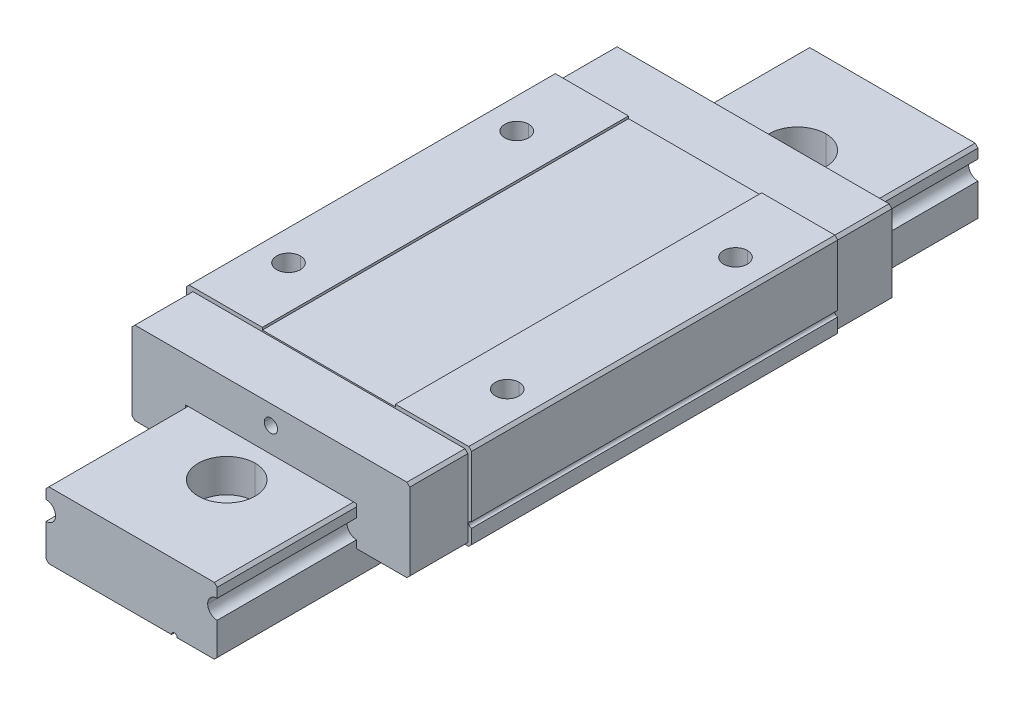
ISO-10303-21;
HEADER;
FILE_DESCRIPTION(('STEP AP214'),'2;1');
FILE_NAME('part.step','',(''),(''),'','','');
FILE_SCHEMA(('AUTOMOTIVE_DESIGN { 1 0 10303 214 1 1 1 1 }'));
ENDSEC;
DATA;
#1=APPLICATION_CONTEXT('core data for automotive mechanical design processes');
#2=APPLICATION_PROTOCOL_DEFINITION('international standard','automotive_design',2000,#1);
#3=PRODUCT_CONTEXT('',#1,'mechanical');
#4=PRODUCT('Part','Part','',(#3));
#5=PRODUCT_RELATED_PRODUCT_CATEGORY('part','',(#4));
#6=PRODUCT_DEFINITION_FORMATION('','',#4);
#7=PRODUCT_DEFINITION_CONTEXT('part definition',#1,'design');
#8=PRODUCT_DEFINITION('design','',#6,#7);
#9=PRODUCT_DEFINITION_SHAPE('','',#8);
#10=(LENGTH_UNIT() NAMED_UNIT(*) SI_UNIT(.MILLI.,.METRE.));
#11=(NAMED_UNIT(*) PLANE_ANGLE_UNIT() SI_UNIT($,.RADIAN.));
#12=(NAMED_UNIT(*) SI_UNIT($,.STERADIAN.) SOLID_ANGLE_UNIT());
#13=UNCERTAINTY_MEASURE_WITH_UNIT(LENGTH_MEASURE(1.E-05),#10,'distance_accuracy_value','');
#14=(GEOMETRIC_REPRESENTATION_CONTEXT(3) GLOBAL_UNCERTAINTY_ASSIGNED_CONTEXT((#13)) GLOBAL_UNIT_ASSIGNED_CONTEXT((#10,
#11,#12)) REPRESENTATION_CONTEXT('',''));
#15=CARTESIAN_POINT('',(0.,0.,0.));
#16=DIRECTION('',(0.,0.,1.));
#17=DIRECTION('',(1.,0.,0.));
#18=AXIS2_PLACEMENT_3D('',#15,#16,#17);
#19=CARTESIAN_POINT('',(0.,7.,-30.));
#20=DIRECTION('',(0.,-1.,0.));
#21=DIRECTION('',(0.,0.,-1.));
#22=AXIS2_PLACEMENT_3D('',#19,#20,#21);
#23=CYLINDRICAL_SURFACE('',#22,3.);
#24=CARTESIAN_POINT('',(0.,7.,-30.));
#25=DIRECTION('',(0.,1.,0.));
#26=DIRECTION('',(0.,0.,-1.));
#27=AXIS2_PLACEMENT_3D('',#24,#25,#26);
#28=CIRCLE('',#27,3.);
#29=CARTESIAN_POINT('',(0.,7.,-33.));
#30=VERTEX_POINT('',#29);
#31=CARTESIAN_POINT('',(0.,7.,-27.));
#32=VERTEX_POINT('',#31);
#33=EDGE_CURVE('P0_E10',#30,#32,#28,.T.);
#34=ORIENTED_EDGE('',*,*,#33,.T.);
#35=DIRECTION('',(0.,-1.,0.));
#36=VECTOR('',#35,1.);
#37=CARTESIAN_POINT('',(0.,7.,-27.));
#38=LINE('',#37,#36);
#39=CARTESIAN_POINT('',(0.,3.5,-27.));
#40=VERTEX_POINT('',#39);
#41=EDGE_CURVE('P0_E496',#32,#40,#38,.T.);
#42=ORIENTED_EDGE('',*,*,#41,.T.);
#43=CARTESIAN_POINT('',(0.,3.5,-30.));
#44=DIRECTION('',(0.,1.,0.));
#45=DIRECTION('',(0.,0.,-1.));
#46=AXIS2_PLACEMENT_3D('',#43,#44,#45);
#47=CIRCLE('',#46,3.);
#48=CARTESIAN_POINT('',(0.,3.5,-33.));
#49=VERTEX_POINT('',#48);
#50=EDGE_CURVE('P0_E378',#49,#40,#47,.T.);
#51=ORIENTED_EDGE('',*,*,#50,.F.);
#52=DIRECTION('',(0.,-1.,0.));
#53=VECTOR('',#52,1.);
#54=CARTESIAN_POINT('',(0.,7.,-33.));
#55=LINE('',#54,#53);
#56=EDGE_CURVE('P0_E550',#30,#49,#55,.T.);
#57=ORIENTED_EDGE('',*,*,#56,.F.);
#58=EDGE_LOOP('',(#34,#42,#51,#57));
#59=FACE_BOUND('',#58,.T.);
#60=ADVANCED_FACE('P0_F16',(#59),#23,.F.);
#61=CARTESIAN_POINT('',(0.,7.,0.));
#62=DIRECTION('',(0.,-1.,0.));
#63=DIRECTION('',(0.,0.,-1.));
#64=AXIS2_PLACEMENT_3D('',#61,#62,#63);
#65=CYLINDRICAL_SURFACE('',#64,3.);
#66=CARTESIAN_POINT('',(0.,7.,0.));
#67=DIRECTION('',(0.,1.,0.));
#68=DIRECTION('',(0.,0.,-1.));
#69=AXIS2_PLACEMENT_3D('',#66,#67,#68);
#70=CIRCLE('',#69,3.);
#71=CARTESIAN_POINT('',(0.,7.,-3.));
#72=VERTEX_POINT('',#71);
#73=CARTESIAN_POINT('',(0.,7.,3.));
#74=VERTEX_POINT('',#73);
#75=EDGE_CURVE('P0_E24',#72,#74,#70,.T.);
#76=ORIENTED_EDGE('',*,*,#75,.T.);
#77=DIRECTION('',(0.,-1.,0.));
#78=VECTOR('',#77,1.);
#79=CARTESIAN_POINT('',(0.,7.,3.));
#80=LINE('',#79,#78);
#81=CARTESIAN_POINT('',(0.,3.5,3.));
#82=VERTEX_POINT('',#81);
#83=EDGE_CURVE('P0_E328',#74,#82,#80,.T.);
#84=ORIENTED_EDGE('',*,*,#83,.T.);
#85=CARTESIAN_POINT('',(0.,3.5,0.));
#86=DIRECTION('',(0.,1.,0.));
#87=DIRECTION('',(0.,0.,-1.));
#88=AXIS2_PLACEMENT_3D('',#85,#86,#87);
#89=CIRCLE('',#88,3.);
#90=CARTESIAN_POINT('',(0.,3.5,-3.));
#91=VERTEX_POINT('',#90);
#92=EDGE_CURVE('P0_E291',#91,#82,#89,.T.);
#93=ORIENTED_EDGE('',*,*,#92,.F.);
#94=DIRECTION('',(0.,-1.,0.));
#95=VECTOR('',#94,1.);
#96=CARTESIAN_POINT('',(0.,7.,-3.));
#97=LINE('',#96,#95);
#98=EDGE_CURVE('P0_E500',#72,#91,#97,.T.);
#99=ORIENTED_EDGE('',*,*,#98,.F.);
#100=EDGE_LOOP('',(#76,#84,#93,#99));
#101=FACE_BOUND('',#100,.T.);
#102=ADVANCED_FACE('P0_F561',(#101),#65,.F.);
#103=CARTESIAN_POINT('',(0.,7.,30.));
#104=DIRECTION('',(0.,-1.,0.));
#105=DIRECTION('',(0.,0.,-1.));
#106=AXIS2_PLACEMENT_3D('',#103,#104,#105);
#107=CYLINDRICAL_SURFACE('',#106,3.);
#108=CARTESIAN_POINT('',(0.,7.,30.));
#109=DIRECTION('',(0.,1.,0.));
#110=DIRECTION('',(0.,0.,-1.));
#111=AXIS2_PLACEMENT_3D('',#108,#109,#110);
#112=CIRCLE('',#111,3.);
#113=CARTESIAN_POINT('',(0.,7.,27.));
#114=VERTEX_POINT('',#113);
#115=CARTESIAN_POINT('',(0.,7.,33.));
#116=VERTEX_POINT('',#115);
#117=EDGE_CURVE('P0_E553',#114,#116,#112,.T.);
#118=ORIENTED_EDGE('',*,*,#117,.T.);
#119=DIRECTION('',(0.,-1.,0.));
#120=VECTOR('',#119,1.);
#121=CARTESIAN_POINT('',(0.,7.,33.));
#122=LINE('',#121,#120);
#123=CARTESIAN_POINT('',(0.,3.5,33.));
#124=VERTEX_POINT('',#123);
#125=EDGE_CURVE('P0_E347',#116,#124,#122,.T.);
#126=ORIENTED_EDGE('',*,*,#125,.T.);
#127=CARTESIAN_POINT('',(0.,3.5,30.));
#128=DIRECTION('',(0.,1.,0.));
#129=DIRECTION('',(0.,0.,-1.));
#130=AXIS2_PLACEMENT_3D('',#127,#128,#129);
#131=CIRCLE('',#130,3.);
#132=CARTESIAN_POINT('',(0.,3.5,27.));
#133=VERTEX_POINT('',#132);
#134=EDGE_CURVE('P0_E473',#133,#124,#131,.T.);
#135=ORIENTED_EDGE('',*,*,#134,.F.);
#136=DIRECTION('',(0.,-1.,0.));
#137=VECTOR('',#136,1.);
#138=CARTESIAN_POINT('',(0.,7.,27.));
#139=LINE('',#138,#137);
#140=EDGE_CURVE('P0_E332',#114,#133,#139,.T.);
#141=ORIENTED_EDGE('',*,*,#140,.F.);
#142=EDGE_LOOP('',(#118,#126,#135,#141));
#143=FACE_BOUND('',#142,.T.);
#144=ADVANCED_FACE('P0_F592',(#143),#107,.F.);
#145=CARTESIAN_POINT('',(0.,-13.942639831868,-30.));
#146=DIRECTION('',(0.,-1.,0.));
#147=DIRECTION('',(0.,0.,-1.));
#148=AXIS2_PLACEMENT_3D('',#145,#146,#147);
#149=CYLINDRICAL_SURFACE('',#148,1.75);
#150=CARTESIAN_POINT('',(0.,3.5,-30.));
#151=DIRECTION('',(0.,1.,0.));
#152=DIRECTION('',(0.,0.,-1.));
#153=AXIS2_PLACEMENT_3D('',#150,#151,#152);
#154=CIRCLE('',#153,1.75);
#155=CARTESIAN_POINT('',(0.,3.5,-31.75));
#156=VERTEX_POINT('',#155);
#157=CARTESIAN_POINT('',(0.,3.5,-28.25));
#158=VERTEX_POINT('',#157);
#159=EDGE_CURVE('P0_E466',#156,#158,#154,.T.);
#160=ORIENTED_EDGE('',*,*,#159,.T.);
#161=DIRECTION('',(0.,-1.,0.));
#162=VECTOR('',#161,1.);
#163=CARTESIAN_POINT('',(0.,-13.942639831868,-28.25));
#164=LINE('',#163,#162);
#165=CARTESIAN_POINT('',(0.,0.,-28.25));
#166=VERTEX_POINT('',#165);
#167=EDGE_CURVE('P0_E406',#158,#166,#164,.T.);
#168=ORIENTED_EDGE('',*,*,#167,.T.);
#169=CARTESIAN_POINT('',(0.,0.,-30.));
#170=DIRECTION('',(0.,-1.,0.));
#171=DIRECTION('',(0.,0.,-1.));
#172=AXIS2_PLACEMENT_3D('',#169,#170,#171);
#173=CIRCLE('',#172,1.75);
#174=CARTESIAN_POINT('',(0.,0.,-31.75));
#175=VERTEX_POINT('',#174);
#176=EDGE_CURVE('P0_E304',#166,#175,#173,.T.);
#177=ORIENTED_EDGE('',*,*,#176,.T.);
#178=DIRECTION('',(0.,-1.,0.));
#179=VECTOR('',#178,1.);
#180=CARTESIAN_POINT('',(0.,-13.942639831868,-31.75));
#181=LINE('',#180,#179);
#182=EDGE_CURVE('P0_E417',#156,#175,#181,.T.);
#183=ORIENTED_EDGE('',*,*,#182,.F.);
#184=EDGE_LOOP('',(#160,#168,#177,#183));
#185=FACE_BOUND('',#184,.T.);
#186=ADVANCED_FACE('P0_F596',(#185),#149,.F.);
#187=CARTESIAN_POINT('',(0.,-13.942639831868,0.));
#188=DIRECTION('',(0.,-1.,0.));
#189=DIRECTION('',(0.,0.,-1.));
#190=AXIS2_PLACEMENT_3D('',#187,#188,#189);
#191=CYLINDRICAL_SURFACE('',#190,1.75);
#192=CARTESIAN_POINT('',(0.,3.5,0.));
#193=DIRECTION('',(0.,1.,0.));
#194=DIRECTION('',(0.,0.,-1.));
#195=AXIS2_PLACEMENT_3D('',#192,#193,#194);
#196=CIRCLE('',#195,1.75);
#197=CARTESIAN_POINT('',(0.,3.5,-1.75));
#198=VERTEX_POINT('',#197);
#199=CARTESIAN_POINT('',(0.,3.5,1.75));
#200=VERTEX_POINT('',#199);
#201=EDGE_CURVE('P0_E375',#198,#200,#196,.T.);
#202=ORIENTED_EDGE('',*,*,#201,.T.);
#203=DIRECTION('',(0.,-1.,0.));
#204=VECTOR('',#203,1.);
#205=CARTESIAN_POINT('',(0.,-13.942639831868,1.75));
#206=LINE('',#205,#204);
#207=CARTESIAN_POINT('',(0.,0.,1.75));
#208=VERTEX_POINT('',#207);
#209=EDGE_CURVE('P0_E386',#200,#208,#206,.T.);
#210=ORIENTED_EDGE('',*,*,#209,.T.);
#211=CARTESIAN_POINT('',(0.,0.,0.));
#212=DIRECTION('',(0.,-1.,0.));
#213=DIRECTION('',(0.,0.,-1.));
#214=AXIS2_PLACEMENT_3D('',#211,#212,#213);
#215=CIRCLE('',#214,1.75);
#216=CARTESIAN_POINT('',(0.,0.,-1.75));
#217=VERTEX_POINT('',#216);
#218=EDGE_CURVE('P0_E301',#208,#217,#215,.T.);
#219=ORIENTED_EDGE('',*,*,#218,.T.);
#220=DIRECTION('',(0.,-1.,0.));
#221=VECTOR('',#220,1.);
#222=CARTESIAN_POINT('',(0.,-13.942639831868,-1.75));
#223=LINE('',#222,#221);
#224=EDGE_CURVE('P0_E398',#198,#217,#223,.T.);
#225=ORIENTED_EDGE('',*,*,#224,.F.);
#226=EDGE_LOOP('',(#202,#210,#219,#225));
#227=FACE_BOUND('',#226,.T.);
#228=ADVANCED_FACE('P0_F600',(#227),#191,.F.);
#229=CARTESIAN_POINT('',(0.,-13.942639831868,30.));
#230=DIRECTION('',(0.,-1.,0.));
#231=DIRECTION('',(0.,0.,-1.));
#232=AXIS2_PLACEMENT_3D('',#229,#230,#231);
#233=CYLINDRICAL_SURFACE('',#232,1.75);
#234=CARTESIAN_POINT('',(0.,3.5,30.));
#235=DIRECTION('',(0.,1.,0.));
#236=DIRECTION('',(0.,0.,-1.));
#237=AXIS2_PLACEMENT_3D('',#234,#235,#236);
#238=CIRCLE('',#237,1.75);
#239=CARTESIAN_POINT('',(0.,3.5,28.25));
#240=VERTEX_POINT('',#239);
#241=CARTESIAN_POINT('',(0.,3.5,31.75));
#242=VERTEX_POINT('',#241);
#243=EDGE_CURVE('P0_E296',#240,#242,#238,.T.);
#244=ORIENTED_EDGE('',*,*,#243,.T.);
#245=DIRECTION('',(0.,-1.,0.));
#246=VECTOR('',#245,1.);
#247=CARTESIAN_POINT('',(0.,-13.942639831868,31.75));
#248=LINE('',#247,#246);
#249=CARTESIAN_POINT('',(0.,0.,31.75));
#250=VERTEX_POINT('',#249);
#251=EDGE_CURVE('P0_E333',#242,#250,#248,.T.);
#252=ORIENTED_EDGE('',*,*,#251,.T.);
#253=CARTESIAN_POINT('',(0.,0.,30.));
#254=DIRECTION('',(0.,-1.,0.));
#255=DIRECTION('',(0.,0.,-1.));
#256=AXIS2_PLACEMENT_3D('',#253,#254,#255);
#257=CIRCLE('',#256,1.75);
#258=CARTESIAN_POINT('',(0.,0.,28.25));
#259=VERTEX_POINT('',#258);
#260=EDGE_CURVE('P0_E305',#250,#259,#257,.T.);
#261=ORIENTED_EDGE('',*,*,#260,.T.);
#262=DIRECTION('',(0.,-1.,0.));
#263=VECTOR('',#262,1.);
#264=CARTESIAN_POINT('',(0.,-13.942639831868,28.25));
#265=LINE('',#264,#263);
#266=EDGE_CURVE('P0_E357',#240,#259,#265,.T.);
#267=ORIENTED_EDGE('',*,*,#266,.F.);
#268=EDGE_LOOP('',(#244,#252,#261,#267));
#269=FACE_BOUND('',#268,.T.);
#270=ADVANCED_FACE('P0_F603',(#269),#233,.F.);
#271=CARTESIAN_POINT('',(9.,4.7,40.));
#272=DIRECTION('',(0.,0.,-1.));
#273=DIRECTION('',(-1.,0.,0.));
#274=AXIS2_PLACEMENT_3D('',#271,#272,#273);
#275=CYLINDRICAL_SURFACE('',#274,1.);
#276=CARTESIAN_POINT('',(9.,4.7,40.));
#277=DIRECTION('',(0.,0.,-1.));
#278=DIRECTION('',(-1.,0.,0.));
#279=AXIS2_PLACEMENT_3D('',#276,#277,#278);
#280=CIRCLE('',#279,1.);
#281=CARTESIAN_POINT('',(8.,4.7,40.));
#282=VERTEX_POINT('',#281);
#283=CARTESIAN_POINT('',(9.,5.7,40.));
#284=VERTEX_POINT('',#283);
#285=EDGE_CURVE('P0_E462',#282,#284,#280,.T.);
#286=ORIENTED_EDGE('',*,*,#285,.F.);
#287=DIRECTION('',(0.,0.,-1.));
#288=VECTOR('',#287,1.);
#289=CARTESIAN_POINT('',(8.,4.7,40.));
#290=LINE('',#289,#288);
#291=CARTESIAN_POINT('',(8.,4.7,-40.));
#292=VERTEX_POINT('',#291);
#293=EDGE_CURVE('P0_E315',#282,#292,#290,.T.);
#294=ORIENTED_EDGE('',*,*,#293,.T.);
#295=CARTESIAN_POINT('',(9.,4.7,-40.));
#296=DIRECTION('',(0.,0.,1.));
#297=DIRECTION('',(-1.,0.,0.));
#298=AXIS2_PLACEMENT_3D('',#295,#296,#297);
#299=CIRCLE('',#298,1.);
#300=CARTESIAN_POINT('',(9.,5.7,-40.));
#301=VERTEX_POINT('',#300);
#302=EDGE_CURVE('P0_E348',#301,#292,#299,.T.);
#303=ORIENTED_EDGE('',*,*,#302,.F.);
#304=DIRECTION('',(0.,0.,1.));
#305=VECTOR('',#304,1.);
#306=CARTESIAN_POINT('',(9.,5.7,40.));
#307=LINE('',#306,#305);
#308=EDGE_CURVE('P0_E469',#301,#284,#307,.T.);
#309=ORIENTED_EDGE('',*,*,#308,.T.);
#310=EDGE_LOOP('',(#286,#294,#303,#309));
#311=FACE_BOUND('',#310,.T.);
#312=ADVANCED_FACE('P0_F607',(#311),#275,.F.);
#313=CARTESIAN_POINT('',(9.,7.,40.));
#314=DIRECTION('',(0.,-1.,0.));
#315=DIRECTION('',(0.,0.,-1.));
#316=AXIS2_PLACEMENT_3D('',#313,#314,#315);
#317=PLANE('',#316);
#318=ORIENTED_EDGE('',*,*,#33,.F.);
#319=CARTESIAN_POINT('',(0.,7.,-30.));
#320=DIRECTION('',(0.,1.,0.));
#321=DIRECTION('',(0.,0.,-1.));
#322=AXIS2_PLACEMENT_3D('',#319,#320,#321);
#323=CIRCLE('',#322,3.);
#324=EDGE_CURVE('P0_E499',#32,#30,#323,.T.);
#325=ORIENTED_EDGE('',*,*,#324,.F.);
#326=EDGE_LOOP('',(#318,#325));
#327=FACE_BOUND('',#326,.T.);
#328=ORIENTED_EDGE('',*,*,#75,.F.);
#329=CARTESIAN_POINT('',(0.,7.,0.));
#330=DIRECTION('',(0.,1.,0.));
#331=DIRECTION('',(0.,0.,-1.));
#332=AXIS2_PLACEMENT_3D('',#329,#330,#331);
#333=CIRCLE('',#332,3.);
#334=EDGE_CURVE('P0_E331',#74,#72,#333,.T.);
#335=ORIENTED_EDGE('',*,*,#334,.F.);
#336=EDGE_LOOP('',(#328,#335));
#337=FACE_BOUND('',#336,.T.);
#338=ORIENTED_EDGE('',*,*,#117,.F.);
#339=CARTESIAN_POINT('',(0.,7.,30.));
#340=DIRECTION('',(0.,1.,0.));
#341=DIRECTION('',(0.,0.,-1.));
#342=AXIS2_PLACEMENT_3D('',#339,#340,#341);
#343=CIRCLE('',#342,3.);
#344=EDGE_CURVE('P0_E486',#116,#114,#343,.T.);
#345=ORIENTED_EDGE('',*,*,#344,.F.);
#346=EDGE_LOOP('',(#338,#345));
#347=FACE_BOUND('',#346,.T.);
#348=DIRECTION('',(1.,0.,0.));
#349=VECTOR('',#348,1.);
#350=CARTESIAN_POINT('',(9.,7.,-40.));
#351=LINE('',#350,#349);
#352=CARTESIAN_POINT('',(-8.7,7.,-40.));
#353=VERTEX_POINT('',#352);
#354=CARTESIAN_POINT('',(8.7,7.,-40.));
#355=VERTEX_POINT('',#354);
#356=EDGE_CURVE('P0_E536',#353,#355,#351,.T.);
#357=ORIENTED_EDGE('',*,*,#356,.F.);
#358=DIRECTION('',(0.,0.,-1.));
#359=VECTOR('',#358,1.);
#360=CARTESIAN_POINT('',(-8.7,7.,40.));
#361=LINE('',#360,#359);
#362=CARTESIAN_POINT('',(-8.7,7.,40.));
#363=VERTEX_POINT('',#362);
#364=EDGE_CURVE('P0_E526',#363,#353,#361,.T.);
#365=ORIENTED_EDGE('',*,*,#364,.F.);
#366=DIRECTION('',(-1.,0.,0.));
#367=VECTOR('',#366,1.);
#368=CARTESIAN_POINT('',(9.,7.,40.));
#369=LINE('',#368,#367);
#370=CARTESIAN_POINT('',(8.7,7.,40.));
#371=VERTEX_POINT('',#370);
#372=EDGE_CURVE('P0_E514',#371,#363,#369,.T.);
#373=ORIENTED_EDGE('',*,*,#372,.F.);
#374=DIRECTION('',(0.,0.,1.));
#375=VECTOR('',#374,1.);
#376=CARTESIAN_POINT('',(8.7,7.,40.));
#377=LINE('',#376,#375);
#378=EDGE_CURVE('P0_E344',#355,#371,#377,.T.);
#379=ORIENTED_EDGE('',*,*,#378,.F.);
#380=EDGE_LOOP('',(#357,#365,#373,#379));
#381=FACE_BOUND('',#380,.T.);
#382=ADVANCED_FACE('P0_F566',(#327,#337,#347,#381),#317,.F.);
#383=CARTESIAN_POINT('',(0.,7.,-30.));
#384=DIRECTION('',(0.,-1.,0.));
#385=DIRECTION('',(0.,0.,-1.));
#386=AXIS2_PLACEMENT_3D('',#383,#384,#385);
#387=CYLINDRICAL_SURFACE('',#386,3.);
#388=ORIENTED_EDGE('',*,*,#41,.F.);
#389=ORIENTED_EDGE('',*,*,#324,.T.);
#390=ORIENTED_EDGE('',*,*,#56,.T.);
#391=CARTESIAN_POINT('',(0.,3.5,-30.));
#392=DIRECTION('',(0.,1.,0.));
#393=DIRECTION('',(0.,0.,-1.));
#394=AXIS2_PLACEMENT_3D('',#391,#392,#393);
#395=CIRCLE('',#394,3.);
#396=EDGE_CURVE('P0_E507',#40,#49,#395,.T.);
#397=ORIENTED_EDGE('',*,*,#396,.F.);
#398=EDGE_LOOP('',(#388,#389,#390,#397));
#399=FACE_BOUND('',#398,.T.);
#400=ADVANCED_FACE('P0_F614',(#399),#387,.F.);
#401=CARTESIAN_POINT('',(0.,7.,0.));
#402=DIRECTION('',(0.,-1.,0.));
#403=DIRECTION('',(0.,0.,-1.));
#404=AXIS2_PLACEMENT_3D('',#401,#402,#403);
#405=CYLINDRICAL_SURFACE('',#404,3.);
#406=ORIENTED_EDGE('',*,*,#83,.F.);
#407=ORIENTED_EDGE('',*,*,#334,.T.);
#408=ORIENTED_EDGE('',*,*,#98,.T.);
#409=CARTESIAN_POINT('',(0.,3.5,0.));
#410=DIRECTION('',(0.,1.,0.));
#411=DIRECTION('',(0.,0.,-1.));
#412=AXIS2_PLACEMENT_3D('',#409,#410,#411);
#413=CIRCLE('',#412,3.);
#414=EDGE_CURVE('P0_E295',#82,#91,#413,.T.);
#415=ORIENTED_EDGE('',*,*,#414,.F.);
#416=EDGE_LOOP('',(#406,#407,#408,#415));
#417=FACE_BOUND('',#416,.T.);
#418=ADVANCED_FACE('P0_F569',(#417),#405,.F.);
#419=CARTESIAN_POINT('',(0.,7.,30.));
#420=DIRECTION('',(0.,-1.,0.));
#421=DIRECTION('',(0.,0.,-1.));
#422=AXIS2_PLACEMENT_3D('',#419,#420,#421);
#423=CYLINDRICAL_SURFACE('',#422,3.);
#424=ORIENTED_EDGE('',*,*,#125,.F.);
#425=ORIENTED_EDGE('',*,*,#344,.T.);
#426=ORIENTED_EDGE('',*,*,#140,.T.);
#427=CARTESIAN_POINT('',(0.,3.5,30.));
#428=DIRECTION('',(0.,1.,0.));
#429=DIRECTION('',(0.,0.,-1.));
#430=AXIS2_PLACEMENT_3D('',#427,#428,#429);
#431=CIRCLE('',#430,3.);
#432=EDGE_CURVE('P0_E446',#124,#133,#431,.T.);
#433=ORIENTED_EDGE('',*,*,#432,.F.);
#434=EDGE_LOOP('',(#424,#425,#426,#433));
#435=FACE_BOUND('',#434,.T.);
#436=ADVANCED_FACE('P0_F620',(#435),#423,.F.);
#437=CARTESIAN_POINT('',(8.7,7.,40.));
#438=DIRECTION('',(-0.707106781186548,-0.707106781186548,0.));
#439=DIRECTION('',(-0.707106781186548,0.707106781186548,0.));
#440=AXIS2_PLACEMENT_3D('',#437,#438,#439);
#441=PLANE('',#440);
#442=DIRECTION('',(-0.707106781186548,0.707106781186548,0.));
#443=VECTOR('',#442,1.);
#444=CARTESIAN_POINT('',(8.7,7.,40.));
#445=LINE('',#444,#443);
#446=CARTESIAN_POINT('',(9.,6.7,40.));
#447=VERTEX_POINT('',#446);
#448=EDGE_CURVE('P0_E465',#447,#371,#445,.T.);
#449=ORIENTED_EDGE('',*,*,#448,.F.);
#450=DIRECTION('',(0.,0.,1.));
#451=VECTOR('',#450,1.);
#452=CARTESIAN_POINT('',(9.,6.7,40.));
#453=LINE('',#452,#451);
#454=CARTESIAN_POINT('',(9.,6.7,-40.));
#455=VERTEX_POINT('',#454);
#456=EDGE_CURVE('P0_E480',#455,#447,#453,.T.);
#457=ORIENTED_EDGE('',*,*,#456,.F.);
#458=DIRECTION('',(0.707106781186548,-0.707106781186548,0.));
#459=VECTOR('',#458,1.);
#460=CARTESIAN_POINT('',(8.7,7.,-40.));
#461=LINE('',#460,#459);
#462=EDGE_CURVE('P0_E413',#355,#455,#461,.T.);
#463=ORIENTED_EDGE('',*,*,#462,.F.);
#464=ORIENTED_EDGE('',*,*,#378,.T.);
#465=EDGE_LOOP('',(#449,#457,#463,#464));
#466=FACE_BOUND('',#465,.T.);
#467=ADVANCED_FACE('P0_F660',(#466),#441,.F.);
#468=CARTESIAN_POINT('',(4.5,0.,-40.));
#469=DIRECTION('',(0.,0.,-1.));
#470=DIRECTION('',(0.,-1.,0.));
#471=AXIS2_PLACEMENT_3D('',#468,#469,#470);
#472=PLANE('',#471);
#473=DIRECTION('',(0.,-1.,0.));
#474=VECTOR('',#473,1.);
#475=CARTESIAN_POINT('',(9.,0.,-40.));
#476=LINE('',#475,#474);
#477=CARTESIAN_POINT('',(9.,3.7,-40.));
#478=VERTEX_POINT('',#477);
#479=CARTESIAN_POINT('',(9.,0.3,-40.));
#480=VERTEX_POINT('',#479);
#481=EDGE_CURVE('P0_E310',#478,#480,#476,.T.);
#482=ORIENTED_EDGE('',*,*,#481,.T.);
#483=DIRECTION('',(-0.707106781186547,-0.707106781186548,0.));
#484=VECTOR('',#483,1.);
#485=CARTESIAN_POINT('',(9.,0.3,-40.));
#486=LINE('',#485,#484);
#487=CARTESIAN_POINT('',(8.7,0.,-40.));
#488=VERTEX_POINT('',#487);
#489=EDGE_CURVE('P0_E259',#480,#488,#486,.T.);
#490=ORIENTED_EDGE('',*,*,#489,.T.);
#491=DIRECTION('',(-1.,0.,0.));
#492=VECTOR('',#491,1.);
#493=CARTESIAN_POINT('',(4.5,0.,-40.));
#494=LINE('',#493,#492);
#495=CARTESIAN_POINT('',(4.8,0.,-40.));
#496=VERTEX_POINT('',#495);
#497=EDGE_CURVE('P0_E253',#488,#496,#494,.T.);
#498=ORIENTED_EDGE('',*,*,#497,.T.);
#499=CARTESIAN_POINT('',(4.5,0.,-40.));
#500=DIRECTION('',(0.,0.,1.));
#501=DIRECTION('',(-1.,0.,0.));
#502=AXIS2_PLACEMENT_3D('',#499,#500,#501);
#503=CIRCLE('',#502,0.3);
#504=CARTESIAN_POINT('',(4.2,0.,-40.));
#505=VERTEX_POINT('',#504);
#506=EDGE_CURVE('P0_E257',#496,#505,#503,.T.);
#507=ORIENTED_EDGE('',*,*,#506,.T.);
#508=DIRECTION('',(-1.,0.,0.));
#509=VECTOR('',#508,1.);
#510=CARTESIAN_POINT('',(4.5,0.,-40.));
#511=LINE('',#510,#509);
#512=CARTESIAN_POINT('',(-8.7,0.,-40.));
#513=VERTEX_POINT('',#512);
#514=EDGE_CURVE('P0_E390',#505,#513,#511,.T.);
#515=ORIENTED_EDGE('',*,*,#514,.T.);
#516=DIRECTION('',(-0.707106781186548,0.707106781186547,0.));
#517=VECTOR('',#516,1.);
#518=CARTESIAN_POINT('',(-8.7,0.,-40.));
#519=LINE('',#518,#517);
#520=CARTESIAN_POINT('',(-9.,0.3,-40.));
#521=VERTEX_POINT('',#520);
#522=EDGE_CURVE('P0_E309',#513,#521,#519,.T.);
#523=ORIENTED_EDGE('',*,*,#522,.T.);
#524=DIRECTION('',(0.,1.,0.));
#525=VECTOR('',#524,1.);
#526=CARTESIAN_POINT('',(-9.,0.,-40.));
#527=LINE('',#526,#525);
#528=CARTESIAN_POINT('',(-9.,3.7,-40.));
#529=VERTEX_POINT('',#528);
#530=EDGE_CURVE('P0_E362',#521,#529,#527,.T.);
#531=ORIENTED_EDGE('',*,*,#530,.T.);
#532=CARTESIAN_POINT('',(-9.,4.7,-40.));
#533=DIRECTION('',(0.,0.,1.));
#534=DIRECTION('',(-1.,0.,0.));
#535=AXIS2_PLACEMENT_3D('',#532,#533,#534);
#536=CIRCLE('',#535,1.);
#537=CARTESIAN_POINT('',(-9.,5.7,-40.));
#538=VERTEX_POINT('',#537);
#539=EDGE_CURVE('P0_E461',#529,#538,#536,.T.);
#540=ORIENTED_EDGE('',*,*,#539,.T.);
#541=DIRECTION('',(0.,1.,0.));
#542=VECTOR('',#541,1.);
#543=CARTESIAN_POINT('',(-9.,7.,-40.));
#544=LINE('',#543,#542);
#545=CARTESIAN_POINT('',(-9.,6.7,-40.));
#546=VERTEX_POINT('',#545);
#547=EDGE_CURVE('P0_E433',#538,#546,#544,.T.);
#548=ORIENTED_EDGE('',*,*,#547,.T.);
#549=DIRECTION('',(0.707106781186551,0.707106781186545,0.));
#550=VECTOR('',#549,1.);
#551=CARTESIAN_POINT('',(-9.,6.7,-40.));
#552=LINE('',#551,#550);
#553=EDGE_CURVE('P0_E532',#546,#353,#552,.T.);
#554=ORIENTED_EDGE('',*,*,#553,.T.);
#555=ORIENTED_EDGE('',*,*,#356,.T.);
#556=ORIENTED_EDGE('',*,*,#462,.T.);
#557=DIRECTION('',(0.,-1.,0.));
#558=VECTOR('',#557,1.);
#559=CARTESIAN_POINT('',(9.,0.,-40.));
#560=LINE('',#559,#558);
#561=EDGE_CURVE('P0_E313',#455,#301,#560,.T.);
#562=ORIENTED_EDGE('',*,*,#561,.T.);
#563=ORIENTED_EDGE('',*,*,#302,.T.);
#564=CARTESIAN_POINT('',(9.,4.7,-40.));
#565=DIRECTION('',(0.,0.,1.));
#566=DIRECTION('',(-1.,0.,0.));
#567=AXIS2_PLACEMENT_3D('',#564,#565,#566);
#568=CIRCLE('',#567,1.);
#569=EDGE_CURVE('P0_E338',#292,#478,#568,.T.);
#570=ORIENTED_EDGE('',*,*,#569,.T.);
#571=EDGE_LOOP('',(#482,#490,#498,#507,#515,#523,#531,#540,#548,#554,#555,#556,#562,#563,#570));
#572=FACE_BOUND('',#571,.T.);
#573=ADVANCED_FACE('P0_F255',(#572),#472,.T.);
#574=CARTESIAN_POINT('',(-9.,6.7,40.));
#575=DIRECTION('',(0.707106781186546,-0.70710678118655,0.));
#576=DIRECTION('',(0.,0.,-1.));
#577=AXIS2_PLACEMENT_3D('',#574,#575,#576);
#578=PLANE('',#577);
#579=DIRECTION('',(-0.70710678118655,-0.707106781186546,0.));
#580=VECTOR('',#579,1.);
#581=CARTESIAN_POINT('',(-9.,6.7,40.));
#582=LINE('',#581,#580);
#583=CARTESIAN_POINT('',(-9.,6.7,40.));
#584=VERTEX_POINT('',#583);
#585=EDGE_CURVE('P0_E518',#363,#584,#582,.T.);
#586=ORIENTED_EDGE('',*,*,#585,.F.);
#587=ORIENTED_EDGE('',*,*,#364,.T.);
#588=ORIENTED_EDGE('',*,*,#553,.F.);
#589=DIRECTION('',(0.,0.,-1.));
#590=VECTOR('',#589,1.);
#591=CARTESIAN_POINT('',(-9.,6.7,40.));
#592=LINE('',#591,#590);
#593=EDGE_CURVE('P0_E429',#584,#546,#592,.T.);
#594=ORIENTED_EDGE('',*,*,#593,.F.);
#595=EDGE_LOOP('',(#586,#587,#588,#594));
#596=FACE_BOUND('',#595,.T.);
#597=ADVANCED_FACE('P0_F621',(#596),#578,.F.);
#598=CARTESIAN_POINT('',(4.5,0.,40.));
#599=DIRECTION('',(0.,0.,-1.));
#600=DIRECTION('',(0.,-1.,0.));
#601=AXIS2_PLACEMENT_3D('',#598,#599,#600);
#602=PLANE('',#601);
#603=DIRECTION('',(0.,1.,0.));
#604=VECTOR('',#603,1.);
#605=CARTESIAN_POINT('',(-9.,0.,40.));
#606=LINE('',#605,#604);
#607=CARTESIAN_POINT('',(-9.,0.3,40.));
#608=VERTEX_POINT('',#607);
#609=CARTESIAN_POINT('',(-9.,3.7,40.));
#610=VERTEX_POINT('',#609);
#611=EDGE_CURVE('P0_E366',#608,#610,#606,.T.);
#612=ORIENTED_EDGE('',*,*,#611,.F.);
#613=DIRECTION('',(0.707106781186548,-0.707106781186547,0.));
#614=VECTOR('',#613,1.);
#615=CARTESIAN_POINT('',(-8.7,0.,40.));
#616=LINE('',#615,#614);
#617=CARTESIAN_POINT('',(-8.7,0.,40.));
#618=VERTEX_POINT('',#617);
#619=EDGE_CURVE('P0_E286',#608,#618,#616,.T.);
#620=ORIENTED_EDGE('',*,*,#619,.T.);
#621=DIRECTION('',(-1.,0.,0.));
#622=VECTOR('',#621,1.);
#623=CARTESIAN_POINT('',(4.5,0.,40.));
#624=LINE('',#623,#622);
#625=CARTESIAN_POINT('',(4.2,0.,40.));
#626=VERTEX_POINT('',#625);
#627=EDGE_CURVE('P0_E387',#626,#618,#624,.T.);
#628=ORIENTED_EDGE('',*,*,#627,.F.);
#629=CARTESIAN_POINT('',(4.5,0.,40.));
#630=DIRECTION('',(0.,0.,-1.));
#631=DIRECTION('',(-1.,0.,0.));
#632=AXIS2_PLACEMENT_3D('',#629,#630,#631);
#633=CIRCLE('',#632,0.3);
#634=CARTESIAN_POINT('',(4.8,0.,40.));
#635=VERTEX_POINT('',#634);
#636=EDGE_CURVE('P0_E274',#626,#635,#633,.T.);
#637=ORIENTED_EDGE('',*,*,#636,.T.);
#638=DIRECTION('',(-1.,0.,0.));
#639=VECTOR('',#638,1.);
#640=CARTESIAN_POINT('',(4.5,0.,40.));
#641=LINE('',#640,#639);
#642=CARTESIAN_POINT('',(8.7,0.,40.));
#643=VERTEX_POINT('',#642);
#644=EDGE_CURVE('P0_E264',#643,#635,#641,.T.);
#645=ORIENTED_EDGE('',*,*,#644,.F.);
#646=DIRECTION('',(0.707106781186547,0.707106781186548,0.));
#647=VECTOR('',#646,1.);
#648=CARTESIAN_POINT('',(9.,0.3,40.));
#649=LINE('',#648,#647);
#650=CARTESIAN_POINT('',(9.,0.3,40.));
#651=VERTEX_POINT('',#650);
#652=EDGE_CURVE('P0_E339',#643,#651,#649,.T.);
#653=ORIENTED_EDGE('',*,*,#652,.T.);
#654=DIRECTION('',(0.,-1.,0.));
#655=VECTOR('',#654,1.);
#656=CARTESIAN_POINT('',(9.,0.,40.));
#657=LINE('',#656,#655);
#658=CARTESIAN_POINT('',(9.,3.7,40.));
#659=VERTEX_POINT('',#658);
#660=EDGE_CURVE('P0_E314',#659,#651,#657,.T.);
#661=ORIENTED_EDGE('',*,*,#660,.F.);
#662=CARTESIAN_POINT('',(9.,4.7,40.));
#663=DIRECTION('',(0.,0.,-1.));
#664=DIRECTION('',(-1.,0.,0.));
#665=AXIS2_PLACEMENT_3D('',#662,#663,#664);
#666=CIRCLE('',#665,1.);
#667=EDGE_CURVE('P0_E319',#659,#282,#666,.T.);
#668=ORIENTED_EDGE('',*,*,#667,.T.);
#669=ORIENTED_EDGE('',*,*,#285,.T.);
#670=DIRECTION('',(0.,-1.,0.));
#671=VECTOR('',#670,1.);
#672=CARTESIAN_POINT('',(9.,0.,40.));
#673=LINE('',#672,#671);
#674=EDGE_CURVE('P0_E474',#447,#284,#673,.T.);
#675=ORIENTED_EDGE('',*,*,#674,.F.);
#676=ORIENTED_EDGE('',*,*,#448,.T.);
#677=ORIENTED_EDGE('',*,*,#372,.T.);
#678=ORIENTED_EDGE('',*,*,#585,.T.);
#679=DIRECTION('',(0.,1.,0.));
#680=VECTOR('',#679,1.);
#681=CARTESIAN_POINT('',(-9.,0.,40.));
#682=LINE('',#681,#680);
#683=CARTESIAN_POINT('',(-9.,5.7,40.));
#684=VERTEX_POINT('',#683);
#685=EDGE_CURVE('P0_E425',#684,#584,#682,.T.);
#686=ORIENTED_EDGE('',*,*,#685,.F.);
#687=CARTESIAN_POINT('',(-9.,4.7,40.));
#688=DIRECTION('',(0.,0.,1.));
#689=DIRECTION('',(-1.,0.,0.));
#690=AXIS2_PLACEMENT_3D('',#687,#688,#689);
#691=CIRCLE('',#690,1.);
#692=EDGE_CURVE('P0_E453',#610,#684,#691,.T.);
#693=ORIENTED_EDGE('',*,*,#692,.F.);
#694=EDGE_LOOP('',(#612,#620,#628,#637,#645,#653,#661,#668,#669,#675,#676,#677,#678,#686,#693));
#695=FACE_BOUND('',#694,.T.);
#696=ADVANCED_FACE('P0_F585',(#695),#602,.F.);
#697=CARTESIAN_POINT('',(0.,3.5,-30.));
#698=DIRECTION('',(0.,-1.,0.));
#699=DIRECTION('',(0.,0.,-1.));
#700=AXIS2_PLACEMENT_3D('',#697,#698,#699);
#701=PLANE('',#700);
#702=ORIENTED_EDGE('',*,*,#159,.F.);
#703=CARTESIAN_POINT('',(0.,3.5,-30.));
#704=DIRECTION('',(0.,1.,0.));
#705=DIRECTION('',(0.,0.,-1.));
#706=AXIS2_PLACEMENT_3D('',#703,#704,#705);
#707=CIRCLE('',#706,1.75);
#708=EDGE_CURVE('P0_E410',#158,#156,#707,.T.);
#709=ORIENTED_EDGE('',*,*,#708,.F.);
#710=EDGE_LOOP('',(#702,#709));
#711=FACE_BOUND('',#710,.T.);
#712=ORIENTED_EDGE('',*,*,#50,.T.);
#713=ORIENTED_EDGE('',*,*,#396,.T.);
#714=EDGE_LOOP('',(#712,#713));
#715=FACE_BOUND('',#714,.T.);
#716=ADVANCED_FACE('P0_F574',(#711,#715),#701,.F.);
#717=CARTESIAN_POINT('',(0.,3.5,0.));
#718=DIRECTION('',(0.,-1.,0.));
#719=DIRECTION('',(0.,0.,-1.));
#720=AXIS2_PLACEMENT_3D('',#717,#718,#719);
#721=PLANE('',#720);
#722=ORIENTED_EDGE('',*,*,#201,.F.);
#723=CARTESIAN_POINT('',(0.,3.5,0.));
#724=DIRECTION('',(0.,1.,0.));
#725=DIRECTION('',(0.,0.,-1.));
#726=AXIS2_PLACEMENT_3D('',#723,#724,#725);
#727=CIRCLE('',#726,1.75);
#728=EDGE_CURVE('P0_E394',#200,#198,#727,.T.);
#729=ORIENTED_EDGE('',*,*,#728,.F.);
#730=EDGE_LOOP('',(#722,#729));
#731=FACE_BOUND('',#730,.T.);
#732=ORIENTED_EDGE('',*,*,#92,.T.);
#733=ORIENTED_EDGE('',*,*,#414,.T.);
#734=EDGE_LOOP('',(#732,#733));
#735=FACE_BOUND('',#734,.T.);
#736=ADVANCED_FACE('P0_F571',(#731,#735),#721,.F.);
#737=CARTESIAN_POINT('',(0.,3.5,30.));
#738=DIRECTION('',(0.,-1.,0.));
#739=DIRECTION('',(0.,0.,-1.));
#740=AXIS2_PLACEMENT_3D('',#737,#738,#739);
#741=PLANE('',#740);
#742=ORIENTED_EDGE('',*,*,#243,.F.);
#743=CARTESIAN_POINT('',(0.,3.5,30.));
#744=DIRECTION('',(0.,1.,0.));
#745=DIRECTION('',(0.,0.,-1.));
#746=AXIS2_PLACEMENT_3D('',#743,#744,#745);
#747=CIRCLE('',#746,1.75);
#748=EDGE_CURVE('P0_E337',#242,#240,#747,.T.);
#749=ORIENTED_EDGE('',*,*,#748,.F.);
#750=EDGE_LOOP('',(#742,#749));
#751=FACE_BOUND('',#750,.T.);
#752=ORIENTED_EDGE('',*,*,#134,.T.);
#753=ORIENTED_EDGE('',*,*,#432,.T.);
#754=EDGE_LOOP('',(#752,#753));
#755=FACE_BOUND('',#754,.T.);
#756=ADVANCED_FACE('P0_F573',(#751,#755),#741,.F.);
#757=CARTESIAN_POINT('',(9.,5.7,40.));
#758=DIRECTION('',(-1.,0.,0.));
#759=DIRECTION('',(0.,0.,1.));
#760=AXIS2_PLACEMENT_3D('',#757,#758,#759);
#761=PLANE('',#760);
#762=ORIENTED_EDGE('',*,*,#561,.F.);
#763=ORIENTED_EDGE('',*,*,#456,.T.);
#764=ORIENTED_EDGE('',*,*,#674,.T.);
#765=ORIENTED_EDGE('',*,*,#308,.F.);
#766=EDGE_LOOP('',(#762,#763,#764,#765));
#767=FACE_BOUND('',#766,.T.);
#768=ADVANCED_FACE('P0_F582',(#767),#761,.F.);
#769=CARTESIAN_POINT('',(9.,0.,40.));
#770=DIRECTION('',(-1.,0.,0.));
#771=DIRECTION('',(0.,0.,1.));
#772=AXIS2_PLACEMENT_3D('',#769,#770,#771);
#773=PLANE('',#772);
#774=ORIENTED_EDGE('',*,*,#660,.T.);
#775=DIRECTION('',(0.,0.,1.));
#776=VECTOR('',#775,1.);
#777=CARTESIAN_POINT('',(9.,0.3,40.));
#778=LINE('',#777,#776);
#779=EDGE_CURVE('P0_E320',#480,#651,#778,.T.);
#780=ORIENTED_EDGE('',*,*,#779,.F.);
#781=ORIENTED_EDGE('',*,*,#481,.F.);
#782=DIRECTION('',(0.,0.,-1.));
#783=VECTOR('',#782,1.);
#784=CARTESIAN_POINT('',(9.,3.7,40.));
#785=LINE('',#784,#783);
#786=EDGE_CURVE('P0_E358',#659,#478,#785,.T.);
#787=ORIENTED_EDGE('',*,*,#786,.F.);
#788=EDGE_LOOP('',(#774,#780,#781,#787));
#789=FACE_BOUND('',#788,.T.);
#790=ADVANCED_FACE('P0_F646',(#789),#773,.F.);
#791=CARTESIAN_POINT('',(-9.,4.7,40.));
#792=DIRECTION('',(0.,0.,-1.));
#793=DIRECTION('',(-1.,0.,0.));
#794=AXIS2_PLACEMENT_3D('',#791,#792,#793);
#795=CYLINDRICAL_SURFACE('',#794,1.);
#796=ORIENTED_EDGE('',*,*,#539,.F.);
#797=DIRECTION('',(0.,0.,-1.));
#798=VECTOR('',#797,1.);
#799=CARTESIAN_POINT('',(-9.,3.7,40.));
#800=LINE('',#799,#798);
#801=EDGE_CURVE('P0_E457',#610,#529,#800,.T.);
#802=ORIENTED_EDGE('',*,*,#801,.F.);
#803=ORIENTED_EDGE('',*,*,#692,.T.);
#804=DIRECTION('',(0.,0.,1.));
#805=VECTOR('',#804,1.);
#806=CARTESIAN_POINT('',(-9.,5.7,40.));
#807=LINE('',#806,#805);
#808=EDGE_CURVE('P0_E265',#538,#684,#807,.T.);
#809=ORIENTED_EDGE('',*,*,#808,.F.);
#810=EDGE_LOOP('',(#796,#802,#803,#809));
#811=FACE_BOUND('',#810,.T.);
#812=ADVANCED_FACE('P0_F670',(#811),#795,.F.);
#813=CARTESIAN_POINT('',(-9.,3.7,40.));
#814=DIRECTION('',(1.,0.,0.));
#815=DIRECTION('',(0.,1.,0.));
#816=AXIS2_PLACEMENT_3D('',#813,#814,#815);
#817=PLANE('',#816);
#818=ORIENTED_EDGE('',*,*,#530,.F.);
#819=DIRECTION('',(0.,0.,-1.));
#820=VECTOR('',#819,1.);
#821=CARTESIAN_POINT('',(-9.,0.3,40.));
#822=LINE('',#821,#820);
#823=EDGE_CURVE('P0_E290',#608,#521,#822,.T.);
#824=ORIENTED_EDGE('',*,*,#823,.F.);
#825=ORIENTED_EDGE('',*,*,#611,.T.);
#826=ORIENTED_EDGE('',*,*,#801,.T.);
#827=EDGE_LOOP('',(#818,#824,#825,#826));
#828=FACE_BOUND('',#827,.T.);
#829=ADVANCED_FACE('P0_F634',(#828),#817,.F.);
#830=CARTESIAN_POINT('',(-9.,0.,40.));
#831=DIRECTION('',(0.,1.,0.));
#832=DIRECTION('',(1.,0.,0.));
#833=AXIS2_PLACEMENT_3D('',#830,#831,#832);
#834=PLANE('',#833);
#835=CARTESIAN_POINT('',(0.,0.,-30.));
#836=DIRECTION('',(0.,-1.,0.));
#837=DIRECTION('',(0.,0.,-1.));
#838=AXIS2_PLACEMENT_3D('',#835,#836,#837);
#839=CIRCLE('',#838,1.75);
#840=EDGE_CURVE('P0_E421',#175,#166,#839,.T.);
#841=ORIENTED_EDGE('',*,*,#840,.F.);
#842=ORIENTED_EDGE('',*,*,#176,.F.);
#843=EDGE_LOOP('',(#841,#842));
#844=FACE_BOUND('',#843,.T.);
#845=CARTESIAN_POINT('',(0.,0.,0.));
#846=DIRECTION('',(0.,-1.,0.));
#847=DIRECTION('',(0.,0.,-1.));
#848=AXIS2_PLACEMENT_3D('',#845,#846,#847);
#849=CIRCLE('',#848,1.75);
#850=EDGE_CURVE('P0_E402',#217,#208,#849,.T.);
#851=ORIENTED_EDGE('',*,*,#850,.F.);
#852=ORIENTED_EDGE('',*,*,#218,.F.);
#853=EDGE_LOOP('',(#851,#852));
#854=FACE_BOUND('',#853,.T.);
#855=CARTESIAN_POINT('',(0.,0.,30.));
#856=DIRECTION('',(0.,-1.,0.));
#857=DIRECTION('',(0.,0.,-1.));
#858=AXIS2_PLACEMENT_3D('',#855,#856,#857);
#859=CIRCLE('',#858,1.75);
#860=EDGE_CURVE('P0_E382',#259,#250,#859,.T.);
#861=ORIENTED_EDGE('',*,*,#860,.F.);
#862=ORIENTED_EDGE('',*,*,#260,.F.);
#863=EDGE_LOOP('',(#861,#862));
#864=FACE_BOUND('',#863,.T.);
#865=ORIENTED_EDGE('',*,*,#627,.T.);
#866=DIRECTION('',(0.,0.,1.));
#867=VECTOR('',#866,1.);
#868=CARTESIAN_POINT('',(-8.7,0.,40.));
#869=LINE('',#868,#867);
#870=EDGE_CURVE('P0_E327',#513,#618,#869,.T.);
#871=ORIENTED_EDGE('',*,*,#870,.F.);
#872=ORIENTED_EDGE('',*,*,#514,.F.);
#873=DIRECTION('',(0.,0.,-1.));
#874=VECTOR('',#873,1.);
#875=CARTESIAN_POINT('',(4.2,0.,40.));
#876=LINE('',#875,#874);
#877=EDGE_CURVE('P0_E279',#626,#505,#876,.T.);
#878=ORIENTED_EDGE('',*,*,#877,.F.);
#879=EDGE_LOOP('',(#865,#871,#872,#878));
#880=FACE_BOUND('',#879,.T.);
#881=ADVANCED_FACE('P0_F640',(#844,#854,#864,#880),#834,.F.);
#882=CARTESIAN_POINT('',(4.8,0.,40.));
#883=DIRECTION('',(0.,1.,0.));
#884=DIRECTION('',(1.,0.,0.));
#885=AXIS2_PLACEMENT_3D('',#882,#883,#884);
#886=PLANE('',#885);
#887=ORIENTED_EDGE('',*,*,#497,.F.);
#888=DIRECTION('',(0.,0.,-1.));
#889=VECTOR('',#888,1.);
#890=CARTESIAN_POINT('',(8.7,0.,40.));
#891=LINE('',#890,#889);
#892=EDGE_CURVE('P0_E343',#643,#488,#891,.T.);
#893=ORIENTED_EDGE('',*,*,#892,.F.);
#894=ORIENTED_EDGE('',*,*,#644,.T.);
#895=DIRECTION('',(0.,0.,1.));
#896=VECTOR('',#895,1.);
#897=CARTESIAN_POINT('',(4.8,0.,40.));
#898=LINE('',#897,#896);
#899=EDGE_CURVE('P0_E268',#496,#635,#898,.T.);
#900=ORIENTED_EDGE('',*,*,#899,.F.);
#901=EDGE_LOOP('',(#887,#893,#894,#900));
#902=FACE_BOUND('',#901,.T.);
#903=ADVANCED_FACE('P0_F269',(#902),#886,.F.);
#904=CARTESIAN_POINT('',(-9.,7.,40.));
#905=DIRECTION('',(1.,0.,0.));
#906=DIRECTION('',(0.,1.,0.));
#907=AXIS2_PLACEMENT_3D('',#904,#905,#906);
#908=PLANE('',#907);
#909=ORIENTED_EDGE('',*,*,#685,.T.);
#910=ORIENTED_EDGE('',*,*,#593,.T.);
#911=ORIENTED_EDGE('',*,*,#547,.F.);
#912=ORIENTED_EDGE('',*,*,#808,.T.);
#913=EDGE_LOOP('',(#909,#910,#911,#912));
#914=FACE_BOUND('',#913,.T.);
#915=ADVANCED_FACE('P0_F666',(#914),#908,.F.);
#916=CARTESIAN_POINT('',(0.,-13.942639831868,-30.));
#917=DIRECTION('',(0.,-1.,0.));
#918=DIRECTION('',(0.,0.,-1.));
#919=AXIS2_PLACEMENT_3D('',#916,#917,#918);
#920=CYLINDRICAL_SURFACE('',#919,1.75);
#921=ORIENTED_EDGE('',*,*,#167,.F.);
#922=ORIENTED_EDGE('',*,*,#708,.T.);
#923=ORIENTED_EDGE('',*,*,#182,.T.);
#924=ORIENTED_EDGE('',*,*,#840,.T.);
#925=EDGE_LOOP('',(#921,#922,#923,#924));
#926=FACE_BOUND('',#925,.T.);
#927=ADVANCED_FACE('P0_F693',(#926),#920,.F.);
#928=CARTESIAN_POINT('',(0.,-13.942639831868,0.));
#929=DIRECTION('',(0.,-1.,0.));
#930=DIRECTION('',(0.,0.,-1.));
#931=AXIS2_PLACEMENT_3D('',#928,#929,#930);
#932=CYLINDRICAL_SURFACE('',#931,1.75);
#933=ORIENTED_EDGE('',*,*,#209,.F.);
#934=ORIENTED_EDGE('',*,*,#728,.T.);
#935=ORIENTED_EDGE('',*,*,#224,.T.);
#936=ORIENTED_EDGE('',*,*,#850,.T.);
#937=EDGE_LOOP('',(#933,#934,#935,#936));
#938=FACE_BOUND('',#937,.T.);
#939=ADVANCED_FACE('P0_F688',(#938),#932,.F.);
#940=CARTESIAN_POINT('',(0.,-13.942639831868,30.));
#941=DIRECTION('',(0.,-1.,0.));
#942=DIRECTION('',(0.,0.,-1.));
#943=AXIS2_PLACEMENT_3D('',#940,#941,#942);
#944=CYLINDRICAL_SURFACE('',#943,1.75);
#945=ORIENTED_EDGE('',*,*,#251,.F.);
#946=ORIENTED_EDGE('',*,*,#748,.T.);
#947=ORIENTED_EDGE('',*,*,#266,.T.);
#948=ORIENTED_EDGE('',*,*,#860,.T.);
#949=EDGE_LOOP('',(#945,#946,#947,#948));
#950=FACE_BOUND('',#949,.T.);
#951=ADVANCED_FACE('P0_F683',(#950),#944,.F.);
#952=CARTESIAN_POINT('',(9.,4.7,40.));
#953=DIRECTION('',(0.,0.,-1.));
#954=DIRECTION('',(-1.,0.,0.));
#955=AXIS2_PLACEMENT_3D('',#952,#953,#954);
#956=CYLINDRICAL_SURFACE('',#955,1.);
#957=ORIENTED_EDGE('',*,*,#293,.F.);
#958=ORIENTED_EDGE('',*,*,#667,.F.);
#959=ORIENTED_EDGE('',*,*,#786,.T.);
#960=ORIENTED_EDGE('',*,*,#569,.F.);
#961=EDGE_LOOP('',(#957,#958,#959,#960));
#962=FACE_BOUND('',#961,.T.);
#963=ADVANCED_FACE('P0_F653',(#962),#956,.F.);
#964=CARTESIAN_POINT('',(9.,0.3,40.));
#965=DIRECTION('',(-0.707106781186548,0.707106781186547,0.));
#966=DIRECTION('',(0.,0.,1.));
#967=AXIS2_PLACEMENT_3D('',#964,#965,#966);
#968=PLANE('',#967);
#969=ORIENTED_EDGE('',*,*,#652,.F.);
#970=ORIENTED_EDGE('',*,*,#892,.T.);
#971=ORIENTED_EDGE('',*,*,#489,.F.);
#972=ORIENTED_EDGE('',*,*,#779,.T.);
#973=EDGE_LOOP('',(#969,#970,#971,#972));
#974=FACE_BOUND('',#973,.T.);
#975=ADVANCED_FACE('P0_F643',(#974),#968,.F.);
#976=CARTESIAN_POINT('',(-8.7,0.,40.));
#977=DIRECTION('',(0.707106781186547,0.707106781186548,0.));
#978=DIRECTION('',(0.,0.,-1.));
#979=AXIS2_PLACEMENT_3D('',#976,#977,#978);
#980=PLANE('',#979);
#981=ORIENTED_EDGE('',*,*,#619,.F.);
#982=ORIENTED_EDGE('',*,*,#823,.T.);
#983=ORIENTED_EDGE('',*,*,#522,.F.);
#984=ORIENTED_EDGE('',*,*,#870,.T.);
#985=EDGE_LOOP('',(#981,#982,#983,#984));
#986=FACE_BOUND('',#985,.T.);
#987=ADVANCED_FACE('P0_F637',(#986),#980,.F.);
#988=CARTESIAN_POINT('',(4.5,0.,40.));
#989=DIRECTION('',(0.,0.,-1.));
#990=DIRECTION('',(-1.,0.,0.));
#991=AXIS2_PLACEMENT_3D('',#988,#989,#990);
#992=CYLINDRICAL_SURFACE('',#991,0.3);
#993=ORIENTED_EDGE('',*,*,#506,.F.);
#994=ORIENTED_EDGE('',*,*,#899,.T.);
#995=ORIENTED_EDGE('',*,*,#636,.F.);
#996=ORIENTED_EDGE('',*,*,#877,.T.);
#997=EDGE_LOOP('',(#993,#994,#995,#996));
#998=FACE_BOUND('',#997,.T.);
#999=ADVANCED_FACE('P0_F277',(#998),#992,.F.);
#1000=CLOSED_SHELL('',(#60,#102,#144,#186,#228,#270,#312,#382,#400,#418,#436,#467,#573,#597,
#696,#716,#736,#756,#768,#790,#812,#829,#881,#903,#915,#927,#939,#951,#963,#975,#987,#999));
#1001=MANIFOLD_SOLID_BREP('P0_B1',#1000);
#1002=CARTESIAN_POINT('',(-11.5,12.,-12.));
#1003=DIRECTION('',(0.,1.,0.));
#1004=DIRECTION('',(0.,0.,1.));
#1005=AXIS2_PLACEMENT_3D('',#1002,#1003,#1004);
#1006=CYLINDRICAL_SURFACE('',#1005,1.25);
#1007=CARTESIAN_POINT('',(-11.5,9.,-12.));
#1008=DIRECTION('',(0.,1.,0.));
#1009=DIRECTION('',(0.,0.,1.));
#1010=AXIS2_PLACEMENT_3D('',#1007,#1008,#1009);
#1011=CIRCLE('',#1010,1.25);
#1012=CARTESIAN_POINT('',(-11.5,9.,-13.25));
#1013=VERTEX_POINT('',#1012);
#1014=CARTESIAN_POINT('',(-11.5,9.,-10.75));
#1015=VERTEX_POINT('',#1014);
#1016=EDGE_CURVE('P1_E10',#1013,#1015,#1011,.T.);
#1017=ORIENTED_EDGE('',*,*,#1016,.F.);
#1018=DIRECTION('',(0.,1.,0.));
#1019=VECTOR('',#1018,1.);
#1020=CARTESIAN_POINT('',(-11.5,12.,-13.25));
#1021=LINE('',#1020,#1019);
#1022=CARTESIAN_POINT('',(-11.5,12.,-13.25));
#1023=VERTEX_POINT('',#1022);
#1024=EDGE_CURVE('P1_E1211',#1013,#1023,#1021,.T.);
#1025=ORIENTED_EDGE('',*,*,#1024,.T.);
#1026=CARTESIAN_POINT('',(-11.5,12.,-12.));
#1027=DIRECTION('',(0.,1.,0.));
#1028=DIRECTION('',(0.,0.,1.));
#1029=AXIS2_PLACEMENT_3D('',#1026,#1027,#1028);
#1030=CIRCLE('',#1029,1.25);
#1031=CARTESIAN_POINT('',(-11.5,12.,-10.75));
#1032=VERTEX_POINT('',#1031);
#1033=EDGE_CURVE('P1_E534',#1023,#1032,#1030,.T.);
#1034=ORIENTED_EDGE('',*,*,#1033,.T.);
#1035=DIRECTION('',(0.,1.,0.));
#1036=VECTOR('',#1035,1.);
#1037=CARTESIAN_POINT('',(-11.5,12.,-10.75));
#1038=LINE('',#1037,#1036);
#1039=EDGE_CURVE('P1_E1191',#1015,#1032,#1038,.T.);
#1040=ORIENTED_EDGE('',*,*,#1039,.F.);
#1041=EDGE_LOOP('',(#1017,#1025,#1034,#1040));
#1042=FACE_BOUND('',#1041,.T.);
#1043=ADVANCED_FACE('P1_F16',(#1042),#1006,.F.);
#1044=CARTESIAN_POINT('',(-11.5,9.,-12.));
#1045=DIRECTION('',(0.,1.,0.));
#1046=DIRECTION('',(0.,0.,1.));
#1047=AXIS2_PLACEMENT_3D('',#1044,#1045,#1046);
#1048=CONICAL_SURFACE('',#1047,1.25,1.02974425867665);
#1049=DIRECTION('',(0.,0.515038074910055,0.857167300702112));
#1050=VECTOR('',#1049,1.);
#1051=CARTESIAN_POINT('',(-11.5,9.,-10.75));
#1052=LINE('',#1051,#1050);
#1053=CARTESIAN_POINT('',(-11.5,8.24892422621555,-12.));
#1054=VERTEX_POINT('',#1053);
#1055=EDGE_CURVE('P1_E872',#1054,#1015,#1052,.T.);
#1056=ORIENTED_EDGE('',*,*,#1055,.F.);
#1057=DIRECTION('',(0.,0.515038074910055,-0.857167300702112));
#1058=VECTOR('',#1057,1.);
#1059=CARTESIAN_POINT('',(-11.5,9.,-13.25));
#1060=LINE('',#1059,#1058);
#1061=EDGE_CURVE('P1_E1176',#1054,#1013,#1060,.T.);
#1062=ORIENTED_EDGE('',*,*,#1061,.T.);
#1063=ORIENTED_EDGE('',*,*,#1016,.T.);
#1064=EDGE_LOOP('',(#1056,#1062,#1063));
#1065=FACE_BOUND('',#1064,.T.);
#1066=ADVANCED_FACE('P1_F2728',(#1065),#1048,.F.);
#1067=CARTESIAN_POINT('',(-11.5,12.,12.));
#1068=DIRECTION('',(0.,1.,0.));
#1069=DIRECTION('',(0.,0.,1.));
#1070=AXIS2_PLACEMENT_3D('',#1067,#1068,#1069);
#1071=CYLINDRICAL_SURFACE('',#1070,1.25);
#1072=CARTESIAN_POINT('',(-11.5,9.,12.));
#1073=DIRECTION('',(0.,1.,0.));
#1074=DIRECTION('',(0.,0.,1.));
#1075=AXIS2_PLACEMENT_3D('',#1072,#1073,#1074);
#1076=CIRCLE('',#1075,1.25);
#1077=CARTESIAN_POINT('',(-11.5,9.,10.75));
#1078=VERTEX_POINT('',#1077);
#1079=CARTESIAN_POINT('',(-11.5,9.,13.25));
#1080=VERTEX_POINT('',#1079);
#1081=EDGE_CURVE('P1_E24',#1078,#1080,#1076,.T.);
#1082=ORIENTED_EDGE('',*,*,#1081,.F.);
#1083=DIRECTION('',(0.,1.,0.));
#1084=VECTOR('',#1083,1.);
#1085=CARTESIAN_POINT('',(-11.5,12.,10.75));
#1086=LINE('',#1085,#1084);
#1087=CARTESIAN_POINT('',(-11.5,12.,10.75));
#1088=VERTEX_POINT('',#1087);
#1089=EDGE_CURVE('P1_E867',#1078,#1088,#1086,.T.);
#1090=ORIENTED_EDGE('',*,*,#1089,.T.);
#1091=CARTESIAN_POINT('',(-11.5,12.,12.));
#1092=DIRECTION('',(0.,1.,0.));
#1093=DIRECTION('',(0.,0.,1.));
#1094=AXIS2_PLACEMENT_3D('',#1091,#1092,#1093);
#1095=CIRCLE('',#1094,1.25);
#1096=CARTESIAN_POINT('',(-11.5,12.,13.25));
#1097=VERTEX_POINT('',#1096);
#1098=EDGE_CURVE('P1_E531',#1088,#1097,#1095,.T.);
#1099=ORIENTED_EDGE('',*,*,#1098,.T.);
#1100=DIRECTION('',(0.,1.,0.));
#1101=VECTOR('',#1100,1.);
#1102=CARTESIAN_POINT('',(-11.5,12.,13.25));
#1103=LINE('',#1102,#1101);
#1104=EDGE_CURVE('P1_E858',#1080,#1097,#1103,.T.);
#1105=ORIENTED_EDGE('',*,*,#1104,.F.);
#1106=EDGE_LOOP('',(#1082,#1090,#1099,#1105));
#1107=FACE_BOUND('',#1106,.T.);
#1108=ADVANCED_FACE('P1_F859',(#1107),#1071,.F.);
#1109=CARTESIAN_POINT('',(-11.5,9.,12.));
#1110=DIRECTION('',(0.,1.,0.));
#1111=DIRECTION('',(0.,0.,1.));
#1112=AXIS2_PLACEMENT_3D('',#1109,#1110,#1111);
#1113=CONICAL_SURFACE('',#1112,1.25,1.02974425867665);
#1114=DIRECTION('',(0.,0.515038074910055,0.857167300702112));
#1115=VECTOR('',#1114,1.);
#1116=CARTESIAN_POINT('',(-11.5,9.,13.25));
#1117=LINE('',#1116,#1115);
#1118=CARTESIAN_POINT('',(-11.5,8.24892422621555,12.));
#1119=VERTEX_POINT('',#1118);
#1120=EDGE_CURVE('P1_E842',#1119,#1080,#1117,.T.);
#1121=ORIENTED_EDGE('',*,*,#1120,.F.);
#1122=DIRECTION('',(0.,0.515038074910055,-0.857167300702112));
#1123=VECTOR('',#1122,1.);
#1124=CARTESIAN_POINT('',(-11.5,9.,10.75));
#1125=LINE('',#1124,#1123);
#1126=EDGE_CURVE('P1_E844',#1119,#1078,#1125,.T.);
#1127=ORIENTED_EDGE('',*,*,#1126,.T.);
#1128=ORIENTED_EDGE('',*,*,#1081,.T.);
#1129=EDGE_LOOP('',(#1121,#1127,#1128));
#1130=FACE_BOUND('',#1129,.T.);
#1131=ADVANCED_FACE('P1_F841',(#1130),#1113,.F.);
#1132=CARTESIAN_POINT('',(11.5,12.,12.));
#1133=DIRECTION('',(0.,1.,0.));
#1134=DIRECTION('',(0.,0.,1.));
#1135=AXIS2_PLACEMENT_3D('',#1132,#1133,#1134);
#1136=CYLINDRICAL_SURFACE('',#1135,1.25);
#1137=CARTESIAN_POINT('',(11.5,9.,12.));
#1138=DIRECTION('',(0.,1.,0.));
#1139=DIRECTION('',(0.,0.,1.));
#1140=AXIS2_PLACEMENT_3D('',#1137,#1138,#1139);
#1141=CIRCLE('',#1140,1.25);
#1142=CARTESIAN_POINT('',(11.5,9.,10.75));
#1143=VERTEX_POINT('',#1142);
#1144=CARTESIAN_POINT('',(11.5,9.,13.25));
#1145=VERTEX_POINT('',#1144);
#1146=EDGE_CURVE('P1_E834',#1143,#1145,#1141,.T.);
#1147=ORIENTED_EDGE('',*,*,#1146,.F.);
#1148=DIRECTION('',(0.,1.,0.));
#1149=VECTOR('',#1148,1.);
#1150=CARTESIAN_POINT('',(11.5,12.,10.75));
#1151=LINE('',#1150,#1149);
#1152=CARTESIAN_POINT('',(11.5,12.,10.75));
#1153=VERTEX_POINT('',#1152);
#1154=EDGE_CURVE('P1_E855',#1143,#1153,#1151,.T.);
#1155=ORIENTED_EDGE('',*,*,#1154,.T.);
#1156=CARTESIAN_POINT('',(11.5,12.,12.));
#1157=DIRECTION('',(0.,1.,0.));
#1158=DIRECTION('',(0.,0.,1.));
#1159=AXIS2_PLACEMENT_3D('',#1156,#1157,#1158);
#1160=CIRCLE('',#1159,1.25);
#1161=CARTESIAN_POINT('',(11.5,12.,13.25));
#1162=VERTEX_POINT('',#1161);
#1163=EDGE_CURVE('P1_E516',#1153,#1162,#1160,.T.);
#1164=ORIENTED_EDGE('',*,*,#1163,.T.);
#1165=DIRECTION('',(0.,1.,0.));
#1166=VECTOR('',#1165,1.);
#1167=CARTESIAN_POINT('',(11.5,12.,13.25));
#1168=LINE('',#1167,#1166);
#1169=EDGE_CURVE('P1_E1164',#1145,#1162,#1168,.T.);
#1170=ORIENTED_EDGE('',*,*,#1169,.F.);
#1171=EDGE_LOOP('',(#1147,#1155,#1164,#1170));
#1172=FACE_BOUND('',#1171,.T.);
#1173=ADVANCED_FACE('P1_F2748',(#1172),#1136,.F.);
#1174=CARTESIAN_POINT('',(11.5,9.,12.));
#1175=DIRECTION('',(0.,1.,0.));
#1176=DIRECTION('',(0.,0.,1.));
#1177=AXIS2_PLACEMENT_3D('',#1174,#1175,#1176);
#1178=CONICAL_SURFACE('',#1177,1.25,1.02974425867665);
#1179=DIRECTION('',(0.,0.515038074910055,0.857167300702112));
#1180=VECTOR('',#1179,1.);
#1181=CARTESIAN_POINT('',(11.5,9.,13.25));
#1182=LINE('',#1181,#1180);
#1183=CARTESIAN_POINT('',(11.5,8.24892422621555,12.));
#1184=VERTEX_POINT('',#1183);
#1185=EDGE_CURVE('P1_E890',#1184,#1145,#1182,.T.);
#1186=ORIENTED_EDGE('',*,*,#1185,.F.);
#1187=DIRECTION('',(0.,0.515038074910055,-0.857167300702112));
#1188=VECTOR('',#1187,1.);
#1189=CARTESIAN_POINT('',(11.5,9.,10.75));
#1190=LINE('',#1189,#1188);
#1191=EDGE_CURVE('P1_E886',#1184,#1143,#1190,.T.);
#1192=ORIENTED_EDGE('',*,*,#1191,.T.);
#1193=ORIENTED_EDGE('',*,*,#1146,.T.);
#1194=EDGE_LOOP('',(#1186,#1192,#1193));
#1195=FACE_BOUND('',#1194,.T.);
#1196=ADVANCED_FACE('P1_F2752',(#1195),#1178,.F.);
#1197=CARTESIAN_POINT('',(11.5,12.,-12.));
#1198=DIRECTION('',(0.,1.,0.));
#1199=DIRECTION('',(0.,0.,1.));
#1200=AXIS2_PLACEMENT_3D('',#1197,#1198,#1199);
#1201=CYLINDRICAL_SURFACE('',#1200,1.25);
#1202=CARTESIAN_POINT('',(11.5,9.,-12.));
#1203=DIRECTION('',(0.,1.,0.));
#1204=DIRECTION('',(0.,0.,1.));
#1205=AXIS2_PLACEMENT_3D('',#1202,#1203,#1204);
#1206=CIRCLE('',#1205,1.25);
#1207=CARTESIAN_POINT('',(11.5,9.,-13.25));
#1208=VERTEX_POINT('',#1207);
#1209=CARTESIAN_POINT('',(11.5,9.,-10.75));
#1210=VERTEX_POINT('',#1209);
#1211=EDGE_CURVE('P1_E831',#1208,#1210,#1206,.T.);
#1212=ORIENTED_EDGE('',*,*,#1211,.F.);
#1213=DIRECTION('',(0.,1.,0.));
#1214=VECTOR('',#1213,1.);
#1215=CARTESIAN_POINT('',(11.5,12.,-13.25));
#1216=LINE('',#1215,#1214);
#1217=CARTESIAN_POINT('',(11.5,12.,-13.25));
#1218=VERTEX_POINT('',#1217);
#1219=EDGE_CURVE('P1_E892',#1208,#1218,#1216,.T.);
#1220=ORIENTED_EDGE('',*,*,#1219,.T.);
#1221=CARTESIAN_POINT('',(11.5,12.,-12.));
#1222=DIRECTION('',(0.,1.,0.));
#1223=DIRECTION('',(0.,0.,1.));
#1224=AXIS2_PLACEMENT_3D('',#1221,#1222,#1223);
#1225=CIRCLE('',#1224,1.25);
#1226=CARTESIAN_POINT('',(11.5,12.,-10.75));
#1227=VERTEX_POINT('',#1226);
#1228=EDGE_CURVE('P1_E1038',#1218,#1227,#1225,.T.);
#1229=ORIENTED_EDGE('',*,*,#1228,.T.);
#1230=DIRECTION('',(0.,1.,0.));
#1231=VECTOR('',#1230,1.);
#1232=CARTESIAN_POINT('',(11.5,12.,-10.75));
#1233=LINE('',#1232,#1231);
#1234=EDGE_CURVE('P1_E906',#1210,#1227,#1233,.T.);
#1235=ORIENTED_EDGE('',*,*,#1234,.F.);
#1236=EDGE_LOOP('',(#1212,#1220,#1229,#1235));
#1237=FACE_BOUND('',#1236,.T.);
#1238=ADVANCED_FACE('P1_F2782',(#1237),#1201,.F.);
#1239=CARTESIAN_POINT('',(11.5,9.,-12.));
#1240=DIRECTION('',(0.,1.,0.));
#1241=DIRECTION('',(0.,0.,1.));
#1242=AXIS2_PLACEMENT_3D('',#1239,#1240,#1241);
#1243=CONICAL_SURFACE('',#1242,1.25,1.02974425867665);
#1244=DIRECTION('',(0.,0.515038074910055,0.857167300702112));
#1245=VECTOR('',#1244,1.);
#1246=CARTESIAN_POINT('',(11.5,9.,-10.75));
#1247=LINE('',#1246,#1245);
#1248=CARTESIAN_POINT('',(11.5,8.24892422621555,-12.));
#1249=VERTEX_POINT('',#1248);
#1250=EDGE_CURVE('P1_E937',#1249,#1210,#1247,.T.);
#1251=ORIENTED_EDGE('',*,*,#1250,.F.);
#1252=DIRECTION('',(0.,0.515038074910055,-0.857167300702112));
#1253=VECTOR('',#1252,1.);
#1254=CARTESIAN_POINT('',(11.5,9.,-13.25));
#1255=LINE('',#1254,#1253);
#1256=EDGE_CURVE('P1_E931',#1249,#1208,#1255,.T.);
#1257=ORIENTED_EDGE('',*,*,#1256,.T.);
#1258=ORIENTED_EDGE('',*,*,#1211,.T.);
#1259=EDGE_LOOP('',(#1251,#1257,#1258));
#1260=FACE_BOUND('',#1259,.T.);
#1261=ADVANCED_FACE('P1_F2306',(#1260),#1243,.F.);
#1262=CARTESIAN_POINT('',(9.,4.7,40.));
#1263=DIRECTION('',(0.,0.,-1.));
#1264=DIRECTION('',(-1.,0.,0.));
#1265=AXIS2_PLACEMENT_3D('',#1262,#1263,#1264);
#1266=CYLINDRICAL_SURFACE('',#1265,1.);
#1267=CARTESIAN_POINT('',(9.,4.7,25.35));
#1268=DIRECTION('',(0.,0.,1.));
#1269=DIRECTION('',(-1.,0.,0.));
#1270=AXIS2_PLACEMENT_3D('',#1267,#1268,#1269);
#1271=CIRCLE('',#1270,1.);
#1272=CARTESIAN_POINT('',(8.,4.7,25.35));
#1273=VERTEX_POINT('',#1272);
#1274=CARTESIAN_POINT('',(9.,3.7,25.35));
#1275=VERTEX_POINT('',#1274);
#1276=EDGE_CURVE('P1_E799',#1273,#1275,#1271,.T.);
#1277=ORIENTED_EDGE('',*,*,#1276,.F.);
#1278=DIRECTION('',(0.,0.,-1.));
#1279=VECTOR('',#1278,1.);
#1280=CARTESIAN_POINT('',(8.,4.7,40.));
#1281=LINE('',#1280,#1279);
#1282=CARTESIAN_POINT('',(8.,4.7,-25.35));
#1283=VERTEX_POINT('',#1282);
#1284=EDGE_CURVE('P1_E782',#1273,#1283,#1281,.T.);
#1285=ORIENTED_EDGE('',*,*,#1284,.T.);
#1286=CARTESIAN_POINT('',(9.,4.7,-25.35));
#1287=DIRECTION('',(0.,0.,1.));
#1288=DIRECTION('',(-1.,0.,0.));
#1289=AXIS2_PLACEMENT_3D('',#1286,#1287,#1288);
#1290=CIRCLE('',#1289,1.);
#1291=CARTESIAN_POINT('',(9.,3.7,-25.35));
#1292=VERTEX_POINT('',#1291);
#1293=EDGE_CURVE('P1_E812',#1283,#1292,#1290,.T.);
#1294=ORIENTED_EDGE('',*,*,#1293,.T.);
#1295=DIRECTION('',(0.,0.,1.));
#1296=VECTOR('',#1295,1.);
#1297=CARTESIAN_POINT('',(9.,3.7,40.));
#1298=LINE('',#1297,#1296);
#1299=EDGE_CURVE('P1_E595',#1292,#1275,#1298,.T.);
#1300=ORIENTED_EDGE('',*,*,#1299,.T.);
#1301=EDGE_LOOP('',(#1277,#1285,#1294,#1300));
#1302=FACE_BOUND('',#1301,.T.);
#1303=ADVANCED_FACE('P1_F1078',(#1302),#1266,.T.);
#1304=CARTESIAN_POINT('',(0.,9.6,-25.35));
#1305=DIRECTION('',(0.,0.,1.));
#1306=DIRECTION('',(1.,0.,0.));
#1307=AXIS2_PLACEMENT_3D('',#1304,#1305,#1306);
#1308=CYLINDRICAL_SURFACE('',#1307,0.7);
#1309=CARTESIAN_POINT('',(0.,9.6,-25.35));
#1310=DIRECTION('',(0.,0.,-1.));
#1311=DIRECTION('',(1.,0.,0.));
#1312=AXIS2_PLACEMENT_3D('',#1309,#1310,#1311);
#1313=CIRCLE('',#1312,0.7);
#1314=CARTESIAN_POINT('',(0.7,9.6,-25.35));
#1315=VERTEX_POINT('',#1314);
#1316=CARTESIAN_POINT('',(-0.7,9.6,-25.35));
#1317=VERTEX_POINT('',#1316);
#1318=EDGE_CURVE('P1_E820',#1315,#1317,#1313,.T.);
#1319=ORIENTED_EDGE('',*,*,#1318,.T.);
#1320=DIRECTION('',(0.,0.,1.));
#1321=VECTOR('',#1320,1.);
#1322=CARTESIAN_POINT('',(-0.7,9.6,-25.35));
#1323=LINE('',#1322,#1321);
#1324=CARTESIAN_POINT('',(-0.699999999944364,9.6,-20.35));
#1325=VERTEX_POINT('',#1324);
#1326=EDGE_CURVE('P1_E630',#1317,#1325,#1323,.T.);
#1327=ORIENTED_EDGE('',*,*,#1326,.T.);
#1328=CARTESIAN_POINT('',(0.,9.6,-20.35));
#1329=DIRECTION('',(0.,0.,-1.));
#1330=DIRECTION('',(1.,0.,0.));
#1331=AXIS2_PLACEMENT_3D('',#1328,#1329,#1330);
#1332=CIRCLE('',#1331,0.7);
#1333=CARTESIAN_POINT('',(0.699999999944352,9.6,-20.35));
#1334=VERTEX_POINT('',#1333);
#1335=EDGE_CURVE('P1_E828',#1334,#1325,#1332,.T.);
#1336=ORIENTED_EDGE('',*,*,#1335,.F.);
#1337=DIRECTION('',(0.,0.,1.));
#1338=VECTOR('',#1337,1.);
#1339=CARTESIAN_POINT('',(0.7,9.6,-25.35));
#1340=LINE('',#1339,#1338);
#1341=EDGE_CURVE('P1_E629',#1315,#1334,#1340,.T.);
#1342=ORIENTED_EDGE('',*,*,#1341,.F.);
#1343=EDGE_LOOP('',(#1319,#1327,#1336,#1342));
#1344=FACE_BOUND('',#1343,.T.);
#1345=ADVANCED_FACE('P1_F1060',(#1344),#1308,.F.);
#1346=CARTESIAN_POINT('',(0.,9.6,25.35));
#1347=DIRECTION('',(0.,0.,-1.));
#1348=DIRECTION('',(-1.,0.,0.));
#1349=AXIS2_PLACEMENT_3D('',#1346,#1347,#1348);
#1350=CYLINDRICAL_SURFACE('',#1349,0.7);
#1351=CARTESIAN_POINT('',(0.,9.6,25.35));
#1352=DIRECTION('',(0.,0.,-1.));
#1353=DIRECTION('',(-1.,0.,0.));
#1354=AXIS2_PLACEMENT_3D('',#1351,#1352,#1353);
#1355=CIRCLE('',#1354,0.7);
#1356=CARTESIAN_POINT('',(0.7,9.6,25.35));
#1357=VERTEX_POINT('',#1356);
#1358=CARTESIAN_POINT('',(-0.7,9.6,25.35));
#1359=VERTEX_POINT('',#1358);
#1360=EDGE_CURVE('P1_E802',#1357,#1359,#1355,.T.);
#1361=ORIENTED_EDGE('',*,*,#1360,.F.);
#1362=DIRECTION('',(0.,0.,-1.));
#1363=VECTOR('',#1362,1.);
#1364=CARTESIAN_POINT('',(0.7,9.6,25.35));
#1365=LINE('',#1364,#1363);
#1366=CARTESIAN_POINT('',(0.699999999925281,9.6,20.35));
#1367=VERTEX_POINT('',#1366);
#1368=EDGE_CURVE('P1_E721',#1357,#1367,#1365,.T.);
#1369=ORIENTED_EDGE('',*,*,#1368,.T.);
#1370=CARTESIAN_POINT('',(0.,9.6,20.35));
#1371=DIRECTION('',(0.,0.,1.));
#1372=DIRECTION('',(-1.,0.,0.));
#1373=AXIS2_PLACEMENT_3D('',#1370,#1371,#1372);
#1374=CIRCLE('',#1373,0.7);
#1375=CARTESIAN_POINT('',(-0.699999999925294,9.6,20.35));
#1376=VERTEX_POINT('',#1375);
#1377=EDGE_CURVE('P1_E825',#1376,#1367,#1374,.T.);
#1378=ORIENTED_EDGE('',*,*,#1377,.F.);
#1379=DIRECTION('',(0.,0.,-1.));
#1380=VECTOR('',#1379,1.);
#1381=CARTESIAN_POINT('',(-0.7,9.6,25.35));
#1382=LINE('',#1381,#1380);
#1383=EDGE_CURVE('P1_E726',#1359,#1376,#1382,.T.);
#1384=ORIENTED_EDGE('',*,*,#1383,.F.);
#1385=EDGE_LOOP('',(#1361,#1369,#1378,#1384));
#1386=FACE_BOUND('',#1385,.T.);
#1387=ADVANCED_FACE('P1_F2420',(#1386),#1350,.F.);
#1388=CARTESIAN_POINT('',(0.,9.6,-20.3500000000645));
#1389=DIRECTION('',(0.,0.,-1.));
#1390=DIRECTION('',(-1.,0.,0.));
#1391=AXIS2_PLACEMENT_3D('',#1388,#1389,#1390);
#1392=CONICAL_SURFACE('',#1391,0.700000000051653,1.02974425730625);
#1393=DIRECTION('',(-0.8571672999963,0.,-0.515038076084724));
#1394=VECTOR('',#1393,1.);
#1395=CARTESIAN_POINT('',(-0.700000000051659,9.6,-20.3500000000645));
#1396=LINE('',#1395,#1394);
#1397=CARTESIAN_POINT('',(-5.68494903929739E-11,9.6,-19.9293975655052));
#1398=VERTEX_POINT('',#1397);
#1399=EDGE_CURVE('P1_E716',#1398,#1325,#1396,.T.);
#1400=ORIENTED_EDGE('',*,*,#1399,.F.);
#1401=DIRECTION('',(0.8571672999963,0.,-0.515038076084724));
#1402=VECTOR('',#1401,1.);
#1403=CARTESIAN_POINT('',(0.700000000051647,9.6,-20.3500000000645));
#1404=LINE('',#1403,#1402);
#1405=EDGE_CURVE('P1_E712',#1398,#1334,#1404,.T.);
#1406=ORIENTED_EDGE('',*,*,#1405,.T.);
#1407=ORIENTED_EDGE('',*,*,#1335,.T.);
#1408=EDGE_LOOP('',(#1400,#1406,#1407));
#1409=FACE_BOUND('',#1408,.T.);
#1410=ADVANCED_FACE('P1_F1056',(#1409),#1392,.F.);
#1411=CARTESIAN_POINT('',(0.,9.6,20.3500000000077));
#1412=DIRECTION('',(0.,0.,1.));
#1413=DIRECTION('',(1.,0.,0.));
#1414=AXIS2_PLACEMENT_3D('',#1411,#1412,#1413);
#1415=CONICAL_SURFACE('',#1414,0.699999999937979,1.02974425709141);
#1416=DIRECTION('',(0.857167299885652,0.,0.515038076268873));
#1417=VECTOR('',#1416,1.);
#1418=CARTESIAN_POINT('',(0.699999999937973,9.6,20.3500000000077));
#1419=LINE('',#1418,#1417);
#1420=CARTESIAN_POINT('',(0.,9.6,19.9293975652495));
#1421=VERTEX_POINT('',#1420);
#1422=EDGE_CURVE('P1_E541',#1421,#1367,#1419,.T.);
#1423=ORIENTED_EDGE('',*,*,#1422,.F.);
#1424=DIRECTION('',(-0.857167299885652,0.,0.515038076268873));
#1425=VECTOR('',#1424,1.);
#1426=CARTESIAN_POINT('',(-0.699999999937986,9.6,20.3500000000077));
#1427=LINE('',#1426,#1425);
#1428=EDGE_CURVE('P1_E546',#1421,#1376,#1427,.T.);
#1429=ORIENTED_EDGE('',*,*,#1428,.T.);
#1430=ORIENTED_EDGE('',*,*,#1377,.T.);
#1431=EDGE_LOOP('',(#1423,#1429,#1430));
#1432=FACE_BOUND('',#1431,.T.);
#1433=ADVANCED_FACE('P1_F2419',(#1432),#1415,.F.);
#1434=CARTESIAN_POINT('',(15.,5.,25.35));
#1435=DIRECTION('',(0.,0.,-1.));
#1436=DIRECTION('',(-1.,0.,0.));
#1437=AXIS2_PLACEMENT_3D('',#1434,#1435,#1436);
#1438=CYLINDRICAL_SURFACE('',#1437,0.3);
#1439=CARTESIAN_POINT('',(15.,5.,19.25));
#1440=DIRECTION('',(0.,0.,-1.));
#1441=DIRECTION('',(-1.,0.,0.));
#1442=AXIS2_PLACEMENT_3D('',#1439,#1440,#1441);
#1443=CIRCLE('',#1442,0.3);
#1444=CARTESIAN_POINT('',(14.7,5.,19.25));
#1445=VERTEX_POINT('',#1444);
#1446=CARTESIAN_POINT('',(15.,5.3,19.25));
#1447=VERTEX_POINT('',#1446);
#1448=EDGE_CURVE('P1_E480',#1445,#1447,#1443,.T.);
#1449=ORIENTED_EDGE('',*,*,#1448,.F.);
#1450=DIRECTION('',(0.,0.,-1.));
#1451=VECTOR('',#1450,1.);
#1452=CARTESIAN_POINT('',(14.7,5.,25.35));
#1453=LINE('',#1452,#1451);
#1454=CARTESIAN_POINT('',(14.7,5.,-19.25));
#1455=VERTEX_POINT('',#1454);
#1456=EDGE_CURVE('P1_E973',#1445,#1455,#1453,.T.);
#1457=ORIENTED_EDGE('',*,*,#1456,.T.);
#1458=CARTESIAN_POINT('',(15.,5.,-19.25));
#1459=DIRECTION('',(0.,0.,1.));
#1460=DIRECTION('',(-1.,0.,0.));
#1461=AXIS2_PLACEMENT_3D('',#1458,#1459,#1460);
#1462=CIRCLE('',#1461,0.3);
#1463=CARTESIAN_POINT('',(15.,5.3,-19.25));
#1464=VERTEX_POINT('',#1463);
#1465=EDGE_CURVE('P1_E500',#1464,#1455,#1462,.T.);
#1466=ORIENTED_EDGE('',*,*,#1465,.F.);
#1467=DIRECTION('',(0.,0.,-1.));
#1468=VECTOR('',#1467,1.);
#1469=CARTESIAN_POINT('',(15.,5.3,25.35));
#1470=LINE('',#1469,#1468);
#1471=EDGE_CURVE('P1_E498',#1447,#1464,#1470,.T.);
#1472=ORIENTED_EDGE('',*,*,#1471,.F.);
#1473=EDGE_LOOP('',(#1449,#1457,#1466,#1472));
#1474=FACE_BOUND('',#1473,.T.);
#1475=ADVANCED_FACE('P1_F499',(#1474),#1438,.F.);
#1476=CARTESIAN_POINT('',(9.,7.,40.));
#1477=DIRECTION('',(0.,-1.,0.));
#1478=DIRECTION('',(0.,0.,-1.));
#1479=AXIS2_PLACEMENT_3D('',#1476,#1477,#1478);
#1480=PLANE('',#1479);
#1481=DIRECTION('',(1.,0.,0.));
#1482=VECTOR('',#1481,1.);
#1483=CARTESIAN_POINT('',(9.,7.,-25.35));
#1484=LINE('',#1483,#1482);
#1485=CARTESIAN_POINT('',(-9.,7.,-25.35));
#1486=VERTEX_POINT('',#1485);
#1487=CARTESIAN_POINT('',(9.,7.,-25.35));
#1488=VERTEX_POINT('',#1487);
#1489=EDGE_CURVE('P1_E47',#1486,#1488,#1484,.T.);
#1490=ORIENTED_EDGE('',*,*,#1489,.T.);
#1491=DIRECTION('',(0.,0.,1.));
#1492=VECTOR('',#1491,1.);
#1493=CARTESIAN_POINT('',(9.,7.,40.));
#1494=LINE('',#1493,#1492);
#1495=CARTESIAN_POINT('',(9.,7.,25.35));
#1496=VERTEX_POINT('',#1495);
#1497=EDGE_CURVE('P1_E37',#1488,#1496,#1494,.T.);
#1498=ORIENTED_EDGE('',*,*,#1497,.T.);
#1499=DIRECTION('',(-1.,0.,0.));
#1500=VECTOR('',#1499,1.);
#1501=CARTESIAN_POINT('',(9.,7.,25.35));
#1502=LINE('',#1501,#1500);
#1503=CARTESIAN_POINT('',(-9.,7.,25.35));
#1504=VERTEX_POINT('',#1503);
#1505=EDGE_CURVE('P1_E792',#1496,#1504,#1502,.T.);
#1506=ORIENTED_EDGE('',*,*,#1505,.T.);
#1507=DIRECTION('',(0.,0.,-1.));
#1508=VECTOR('',#1507,1.);
#1509=CARTESIAN_POINT('',(-9.,7.,40.));
#1510=LINE('',#1509,#1508);
#1511=EDGE_CURVE('P1_E809',#1504,#1486,#1510,.T.);
#1512=ORIENTED_EDGE('',*,*,#1511,.T.);
#1513=EDGE_LOOP('',(#1490,#1498,#1506,#1512));
#1514=FACE_BOUND('',#1513,.T.);
#1515=ADVANCED_FACE('P1_F1089',(#1514),#1480,.T.);
#1516=CARTESIAN_POINT('',(9.,5.7,40.));
#1517=DIRECTION('',(-1.,0.,0.));
#1518=DIRECTION('',(0.,0.,1.));
#1519=AXIS2_PLACEMENT_3D('',#1516,#1517,#1518);
#1520=PLANE('',#1519);
#1521=DIRECTION('',(0.,-1.,0.));
#1522=VECTOR('',#1521,1.);
#1523=CARTESIAN_POINT('',(9.,5.7,-25.35));
#1524=LINE('',#1523,#1522);
#1525=CARTESIAN_POINT('',(9.,5.7,-25.35));
#1526=VERTEX_POINT('',#1525);
#1527=EDGE_CURVE('P1_E815',#1488,#1526,#1524,.T.);
#1528=ORIENTED_EDGE('',*,*,#1527,.T.);
#1529=DIRECTION('',(0.,0.,1.));
#1530=VECTOR('',#1529,1.);
#1531=CARTESIAN_POINT('',(9.,5.7,40.));
#1532=LINE('',#1531,#1530);
#1533=CARTESIAN_POINT('',(9.,5.7,25.35));
#1534=VERTEX_POINT('',#1533);
#1535=EDGE_CURVE('P1_E737',#1526,#1534,#1532,.T.);
#1536=ORIENTED_EDGE('',*,*,#1535,.T.);
#1537=DIRECTION('',(0.,1.,0.));
#1538=VECTOR('',#1537,1.);
#1539=CARTESIAN_POINT('',(9.,5.7,25.35));
#1540=LINE('',#1539,#1538);
#1541=EDGE_CURVE('P1_E796',#1534,#1496,#1540,.T.);
#1542=ORIENTED_EDGE('',*,*,#1541,.T.);
#1543=ORIENTED_EDGE('',*,*,#1497,.F.);
#1544=EDGE_LOOP('',(#1528,#1536,#1542,#1543));
#1545=FACE_BOUND('',#1544,.T.);
#1546=ADVANCED_FACE('P1_F1068',(#1545),#1520,.T.);
#1547=CARTESIAN_POINT('',(15.,5.,-25.35));
#1548=DIRECTION('',(0.,0.,1.));
#1549=DIRECTION('',(1.,0.,0.));
#1550=AXIS2_PLACEMENT_3D('',#1547,#1548,#1549);
#1551=PLANE('',#1550);
#1552=ORIENTED_EDGE('',*,*,#1318,.F.);
#1553=CARTESIAN_POINT('',(0.,9.6,-25.35));
#1554=DIRECTION('',(0.,0.,-1.));
#1555=DIRECTION('',(1.,0.,0.));
#1556=AXIS2_PLACEMENT_3D('',#1553,#1554,#1555);
#1557=CIRCLE('',#1556,0.7);
#1558=EDGE_CURVE('P1_E625',#1317,#1315,#1557,.T.);
#1559=ORIENTED_EDGE('',*,*,#1558,.F.);
#1560=EDGE_LOOP('',(#1552,#1559));
#1561=FACE_BOUND('',#1560,.T.);
#1562=DIRECTION('',(0.,-1.,0.));
#1563=VECTOR('',#1562,1.);
#1564=CARTESIAN_POINT('',(9.,0.,-25.35));
#1565=LINE('',#1564,#1563);
#1566=CARTESIAN_POINT('',(9.,2.9,-25.35));
#1567=VERTEX_POINT('',#1566);
#1568=EDGE_CURVE('P1_E578',#1292,#1567,#1565,.T.);
#1569=ORIENTED_EDGE('',*,*,#1568,.F.);
#1570=ORIENTED_EDGE('',*,*,#1293,.F.);
#1571=CARTESIAN_POINT('',(9.,4.7,-25.35));
#1572=DIRECTION('',(0.,0.,1.));
#1573=DIRECTION('',(-1.,0.,0.));
#1574=AXIS2_PLACEMENT_3D('',#1571,#1572,#1573);
#1575=CIRCLE('',#1574,1.);
#1576=EDGE_CURVE('P1_E741',#1526,#1283,#1575,.T.);
#1577=ORIENTED_EDGE('',*,*,#1576,.F.);
#1578=ORIENTED_EDGE('',*,*,#1527,.F.);
#1579=ORIENTED_EDGE('',*,*,#1489,.F.);
#1580=DIRECTION('',(0.,1.,0.));
#1581=VECTOR('',#1580,1.);
#1582=CARTESIAN_POINT('',(-9.,5.,-25.35));
#1583=LINE('',#1582,#1581);
#1584=CARTESIAN_POINT('',(-9.,5.7,-25.35));
#1585=VERTEX_POINT('',#1584);
#1586=EDGE_CURVE('P1_E805',#1585,#1486,#1583,.T.);
#1587=ORIENTED_EDGE('',*,*,#1586,.F.);
#1588=CARTESIAN_POINT('',(-9.,4.7,-25.35));
#1589=DIRECTION('',(0.,0.,1.));
#1590=DIRECTION('',(-1.,0.,0.));
#1591=AXIS2_PLACEMENT_3D('',#1588,#1589,#1590);
#1592=CIRCLE('',#1591,1.);
#1593=CARTESIAN_POINT('',(-9.,3.7,-25.35));
#1594=VERTEX_POINT('',#1593);
#1595=EDGE_CURVE('P1_E764',#1594,#1585,#1592,.T.);
#1596=ORIENTED_EDGE('',*,*,#1595,.F.);
#1597=DIRECTION('',(0.,1.,0.));
#1598=VECTOR('',#1597,1.);
#1599=CARTESIAN_POINT('',(-9.,3.7,-25.35));
#1600=LINE('',#1599,#1598);
#1601=CARTESIAN_POINT('',(-9.,2.9,-25.35));
#1602=VERTEX_POINT('',#1601);
#1603=EDGE_CURVE('P1_E672',#1602,#1594,#1600,.T.);
#1604=ORIENTED_EDGE('',*,*,#1603,.F.);
#1605=DIRECTION('',(1.,0.,0.));
#1606=VECTOR('',#1605,1.);
#1607=CARTESIAN_POINT('',(15.,2.9,-25.35));
#1608=LINE('',#1607,#1606);
#1609=CARTESIAN_POINT('',(-14.3,2.9,-25.35));
#1610=VERTEX_POINT('',#1609);
#1611=EDGE_CURVE('P1_E761',#1610,#1602,#1608,.T.);
#1612=ORIENTED_EDGE('',*,*,#1611,.F.);
#1613=DIRECTION('',(-0.707106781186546,0.707106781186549,0.));
#1614=VECTOR('',#1613,1.);
#1615=CARTESIAN_POINT('',(-14.6,3.2,-25.35));
#1616=LINE('',#1615,#1614);
#1617=CARTESIAN_POINT('',(-14.6,3.2,-25.35));
#1618=VERTEX_POINT('',#1617);
#1619=EDGE_CURVE('P1_E603',#1610,#1618,#1616,.T.);
#1620=ORIENTED_EDGE('',*,*,#1619,.T.);
#1621=DIRECTION('',(0.,-1.,0.));
#1622=VECTOR('',#1621,1.);
#1623=CARTESIAN_POINT('',(-14.6,5.,-25.35));
#1624=LINE('',#1623,#1622);
#1625=CARTESIAN_POINT('',(-14.6,11.3,-25.35));
#1626=VERTEX_POINT('',#1625);
#1627=EDGE_CURVE('P1_E755',#1626,#1618,#1624,.T.);
#1628=ORIENTED_EDGE('',*,*,#1627,.F.);
#1629=DIRECTION('',(0.70710678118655,0.707106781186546,0.));
#1630=VECTOR('',#1629,1.);
#1631=CARTESIAN_POINT('',(-14.3,11.6,-25.35));
#1632=LINE('',#1631,#1630);
#1633=CARTESIAN_POINT('',(-14.3,11.6,-25.35));
#1634=VERTEX_POINT('',#1633);
#1635=EDGE_CURVE('P1_E689',#1626,#1634,#1632,.T.);
#1636=ORIENTED_EDGE('',*,*,#1635,.T.);
#1637=DIRECTION('',(-1.,0.,0.));
#1638=VECTOR('',#1637,1.);
#1639=CARTESIAN_POINT('',(15.,11.6,-25.35));
#1640=LINE('',#1639,#1638);
#1641=CARTESIAN_POINT('',(14.3,11.6,-25.35));
#1642=VERTEX_POINT('',#1641);
#1643=EDGE_CURVE('P1_E752',#1642,#1634,#1640,.T.);
#1644=ORIENTED_EDGE('',*,*,#1643,.F.);
#1645=DIRECTION('',(0.707106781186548,-0.707106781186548,0.));
#1646=VECTOR('',#1645,1.);
#1647=CARTESIAN_POINT('',(14.6,11.3,-25.35));
#1648=LINE('',#1647,#1646);
#1649=CARTESIAN_POINT('',(14.6,11.3,-25.35));
#1650=VERTEX_POINT('',#1649);
#1651=EDGE_CURVE('P1_E555',#1642,#1650,#1648,.T.);
#1652=ORIENTED_EDGE('',*,*,#1651,.T.);
#1653=DIRECTION('',(0.,1.,0.));
#1654=VECTOR('',#1653,1.);
#1655=CARTESIAN_POINT('',(14.6,5.,-25.35));
#1656=LINE('',#1655,#1654);
#1657=CARTESIAN_POINT('',(14.6,3.2,-25.35));
#1658=VERTEX_POINT('',#1657);
#1659=EDGE_CURVE('P1_E751',#1658,#1650,#1656,.T.);
#1660=ORIENTED_EDGE('',*,*,#1659,.F.);
#1661=DIRECTION('',(-0.707106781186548,-0.707106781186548,0.));
#1662=VECTOR('',#1661,1.);
#1663=CARTESIAN_POINT('',(14.3,2.9,-25.35));
#1664=LINE('',#1663,#1662);
#1665=CARTESIAN_POINT('',(14.3,2.9,-25.35));
#1666=VERTEX_POINT('',#1665);
#1667=EDGE_CURVE('P1_E620',#1658,#1666,#1664,.T.);
#1668=ORIENTED_EDGE('',*,*,#1667,.T.);
#1669=DIRECTION('',(1.,0.,0.));
#1670=VECTOR('',#1669,1.);
#1671=CARTESIAN_POINT('',(15.,2.9,-25.35));
#1672=LINE('',#1671,#1670);
#1673=EDGE_CURVE('P1_E748',#1567,#1666,#1672,.T.);
#1674=ORIENTED_EDGE('',*,*,#1673,.F.);
#1675=EDGE_LOOP('',(#1569,#1570,#1577,#1578,#1579,#1587,#1596,#1604,#1612,#1620,#1628,#1636,
#1644,#1652,#1660,#1668,#1674));
#1676=FACE_BOUND('',#1675,.T.);
#1677=ADVANCED_FACE('P1_F1065',(#1561,#1676),#1551,.F.);
#1678=CARTESIAN_POINT('',(-9.,7.,40.));
#1679=DIRECTION('',(1.,0.,0.));
#1680=DIRECTION('',(0.,1.,0.));
#1681=AXIS2_PLACEMENT_3D('',#1678,#1679,#1680);
#1682=PLANE('',#1681);
#1683=ORIENTED_EDGE('',*,*,#1586,.T.);
#1684=ORIENTED_EDGE('',*,*,#1511,.F.);
#1685=DIRECTION('',(0.,-1.,0.));
#1686=VECTOR('',#1685,1.);
#1687=CARTESIAN_POINT('',(-9.,7.,25.35));
#1688=LINE('',#1687,#1686);
#1689=CARTESIAN_POINT('',(-9.,5.7,25.35));
#1690=VERTEX_POINT('',#1689);
#1691=EDGE_CURVE('P1_E789',#1504,#1690,#1688,.T.);
#1692=ORIENTED_EDGE('',*,*,#1691,.T.);
#1693=DIRECTION('',(0.,0.,-1.));
#1694=VECTOR('',#1693,1.);
#1695=CARTESIAN_POINT('',(-9.,5.7,40.));
#1696=LINE('',#1695,#1694);
#1697=EDGE_CURVE('P1_E768',#1690,#1585,#1696,.T.);
#1698=ORIENTED_EDGE('',*,*,#1697,.T.);
#1699=EDGE_LOOP('',(#1683,#1684,#1692,#1698));
#1700=FACE_BOUND('',#1699,.T.);
#1701=ADVANCED_FACE('P1_F1067',(#1700),#1682,.T.);
#1702=CARTESIAN_POINT('',(15.,5.,25.35));
#1703=DIRECTION('',(0.,0.,1.));
#1704=DIRECTION('',(1.,0.,0.));
#1705=AXIS2_PLACEMENT_3D('',#1702,#1703,#1704);
#1706=PLANE('',#1705);
#1707=CARTESIAN_POINT('',(0.,9.6,25.35));
#1708=DIRECTION('',(0.,0.,-1.));
#1709=DIRECTION('',(-1.,0.,0.));
#1710=AXIS2_PLACEMENT_3D('',#1707,#1708,#1709);
#1711=CIRCLE('',#1710,0.7);
#1712=EDGE_CURVE('P1_E722',#1359,#1357,#1711,.T.);
#1713=ORIENTED_EDGE('',*,*,#1712,.T.);
#1714=ORIENTED_EDGE('',*,*,#1360,.T.);
#1715=EDGE_LOOP('',(#1713,#1714));
#1716=FACE_BOUND('',#1715,.T.);
#1717=DIRECTION('',(1.,0.,0.));
#1718=VECTOR('',#1717,1.);
#1719=CARTESIAN_POINT('',(15.,2.9,25.35));
#1720=LINE('',#1719,#1718);
#1721=CARTESIAN_POINT('',(-14.3,2.9,25.35));
#1722=VERTEX_POINT('',#1721);
#1723=CARTESIAN_POINT('',(-9.,2.9,25.35));
#1724=VERTEX_POINT('',#1723);
#1725=EDGE_CURVE('P1_E758',#1722,#1724,#1720,.T.);
#1726=ORIENTED_EDGE('',*,*,#1725,.T.);
#1727=DIRECTION('',(0.,-1.,0.));
#1728=VECTOR('',#1727,1.);
#1729=CARTESIAN_POINT('',(-9.,3.7,25.35));
#1730=LINE('',#1729,#1728);
#1731=CARTESIAN_POINT('',(-9.,3.7,25.35));
#1732=VERTEX_POINT('',#1731);
#1733=EDGE_CURVE('P1_E671',#1732,#1724,#1730,.T.);
#1734=ORIENTED_EDGE('',*,*,#1733,.F.);
#1735=CARTESIAN_POINT('',(-9.,4.7,25.35));
#1736=DIRECTION('',(0.,0.,1.));
#1737=DIRECTION('',(-1.,0.,0.));
#1738=AXIS2_PLACEMENT_3D('',#1735,#1736,#1737);
#1739=CIRCLE('',#1738,1.);
#1740=EDGE_CURVE('P1_E772',#1732,#1690,#1739,.T.);
#1741=ORIENTED_EDGE('',*,*,#1740,.T.);
#1742=ORIENTED_EDGE('',*,*,#1691,.F.);
#1743=ORIENTED_EDGE('',*,*,#1505,.F.);
#1744=ORIENTED_EDGE('',*,*,#1541,.F.);
#1745=CARTESIAN_POINT('',(9.,4.7,25.35));
#1746=DIRECTION('',(0.,0.,1.));
#1747=DIRECTION('',(-1.,0.,0.));
#1748=AXIS2_PLACEMENT_3D('',#1745,#1746,#1747);
#1749=CIRCLE('',#1748,1.);
#1750=EDGE_CURVE('P1_E742',#1534,#1273,#1749,.T.);
#1751=ORIENTED_EDGE('',*,*,#1750,.T.);
#1752=ORIENTED_EDGE('',*,*,#1276,.T.);
#1753=DIRECTION('',(0.,1.,0.));
#1754=VECTOR('',#1753,1.);
#1755=CARTESIAN_POINT('',(9.,0.,25.35));
#1756=LINE('',#1755,#1754);
#1757=CARTESIAN_POINT('',(9.,2.9,25.35));
#1758=VERTEX_POINT('',#1757);
#1759=EDGE_CURVE('P1_E577',#1758,#1275,#1756,.T.);
#1760=ORIENTED_EDGE('',*,*,#1759,.F.);
#1761=DIRECTION('',(1.,0.,0.));
#1762=VECTOR('',#1761,1.);
#1763=CARTESIAN_POINT('',(15.,2.9,25.35));
#1764=LINE('',#1763,#1762);
#1765=CARTESIAN_POINT('',(14.3,2.9,25.35));
#1766=VERTEX_POINT('',#1765);
#1767=EDGE_CURVE('P1_E745',#1758,#1766,#1764,.T.);
#1768=ORIENTED_EDGE('',*,*,#1767,.T.);
#1769=DIRECTION('',(-0.707106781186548,-0.707106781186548,0.));
#1770=VECTOR('',#1769,1.);
#1771=CARTESIAN_POINT('',(14.6,3.2,25.35));
#1772=LINE('',#1771,#1770);
#1773=CARTESIAN_POINT('',(14.6,3.2,25.35));
#1774=VERTEX_POINT('',#1773);
#1775=EDGE_CURVE('P1_E527',#1774,#1766,#1772,.T.);
#1776=ORIENTED_EDGE('',*,*,#1775,.F.);
#1777=DIRECTION('',(0.,1.,0.));
#1778=VECTOR('',#1777,1.);
#1779=CARTESIAN_POINT('',(14.6,5.,25.35));
#1780=LINE('',#1779,#1778);
#1781=CARTESIAN_POINT('',(14.6,11.3,25.35));
#1782=VERTEX_POINT('',#1781);
#1783=EDGE_CURVE('P1_E730',#1774,#1782,#1780,.T.);
#1784=ORIENTED_EDGE('',*,*,#1783,.T.);
#1785=DIRECTION('',(0.707106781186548,-0.707106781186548,0.));
#1786=VECTOR('',#1785,1.);
#1787=CARTESIAN_POINT('',(14.3,11.6,25.35));
#1788=LINE('',#1787,#1786);
#1789=CARTESIAN_POINT('',(14.3,11.6,25.35));
#1790=VERTEX_POINT('',#1789);
#1791=EDGE_CURVE('P1_E550',#1790,#1782,#1788,.T.);
#1792=ORIENTED_EDGE('',*,*,#1791,.F.);
#1793=DIRECTION('',(-1.,0.,0.));
#1794=VECTOR('',#1793,1.);
#1795=CARTESIAN_POINT('',(15.,11.6,25.35));
#1796=LINE('',#1795,#1794);
#1797=CARTESIAN_POINT('',(-14.3,11.6,25.35));
#1798=VERTEX_POINT('',#1797);
#1799=EDGE_CURVE('P1_E733',#1790,#1798,#1796,.T.);
#1800=ORIENTED_EDGE('',*,*,#1799,.T.);
#1801=DIRECTION('',(-0.707106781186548,-0.707106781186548,0.));
#1802=VECTOR('',#1801,1.);
#1803=CARTESIAN_POINT('',(-14.6,11.3,25.35));
#1804=LINE('',#1803,#1802);
#1805=CARTESIAN_POINT('',(-14.6,11.3,25.35));
#1806=VERTEX_POINT('',#1805);
#1807=EDGE_CURVE('P1_E611',#1798,#1806,#1804,.T.);
#1808=ORIENTED_EDGE('',*,*,#1807,.T.);
#1809=DIRECTION('',(0.,-1.,0.));
#1810=VECTOR('',#1809,1.);
#1811=CARTESIAN_POINT('',(-14.6,5.,25.35));
#1812=LINE('',#1811,#1810);
#1813=CARTESIAN_POINT('',(-14.6,3.2,25.35));
#1814=VERTEX_POINT('',#1813);
#1815=EDGE_CURVE('P1_E736',#1806,#1814,#1812,.T.);
#1816=ORIENTED_EDGE('',*,*,#1815,.T.);
#1817=DIRECTION('',(0.707106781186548,-0.707106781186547,0.));
#1818=VECTOR('',#1817,1.);
#1819=CARTESIAN_POINT('',(-14.3,2.9,25.35));
#1820=LINE('',#1819,#1818);
#1821=EDGE_CURVE('P1_E697',#1814,#1722,#1820,.T.);
#1822=ORIENTED_EDGE('',*,*,#1821,.T.);
#1823=EDGE_LOOP('',(#1726,#1734,#1741,#1742,#1743,#1744,#1751,#1752,#1760,#1768,#1776,#1784,
#1792,#1800,#1808,#1816,#1822));
#1824=FACE_BOUND('',#1823,.T.);
#1825=ADVANCED_FACE('P1_F1087',(#1716,#1824),#1706,.T.);
#1826=CARTESIAN_POINT('',(9.,4.7,40.));
#1827=DIRECTION('',(0.,0.,-1.));
#1828=DIRECTION('',(-1.,0.,0.));
#1829=AXIS2_PLACEMENT_3D('',#1826,#1827,#1828);
#1830=CYLINDRICAL_SURFACE('',#1829,1.);
#1831=ORIENTED_EDGE('',*,*,#1284,.F.);
#1832=ORIENTED_EDGE('',*,*,#1750,.F.);
#1833=ORIENTED_EDGE('',*,*,#1535,.F.);
#1834=ORIENTED_EDGE('',*,*,#1576,.T.);
#1835=EDGE_LOOP('',(#1831,#1832,#1833,#1834));
#1836=FACE_BOUND('',#1835,.T.);
#1837=ADVANCED_FACE('P1_F1082',(#1836),#1830,.T.);
#1838=CARTESIAN_POINT('',(0.,9.6,-25.35));
#1839=DIRECTION('',(0.,0.,1.));
#1840=DIRECTION('',(1.,0.,0.));
#1841=AXIS2_PLACEMENT_3D('',#1838,#1839,#1840);
#1842=CYLINDRICAL_SURFACE('',#1841,0.7);
#1843=ORIENTED_EDGE('',*,*,#1326,.F.);
#1844=ORIENTED_EDGE('',*,*,#1558,.T.);
#1845=ORIENTED_EDGE('',*,*,#1341,.T.);
#1846=CARTESIAN_POINT('',(0.,9.6,-20.35));
#1847=DIRECTION('',(0.,0.,-1.));
#1848=DIRECTION('',(1.,0.,0.));
#1849=AXIS2_PLACEMENT_3D('',#1846,#1847,#1848);
#1850=CIRCLE('',#1849,0.7);
#1851=EDGE_CURVE('P1_E717',#1325,#1334,#1850,.T.);
#1852=ORIENTED_EDGE('',*,*,#1851,.F.);
#1853=EDGE_LOOP('',(#1843,#1844,#1845,#1852));
#1854=FACE_BOUND('',#1853,.T.);
#1855=ADVANCED_FACE('P1_F1063',(#1854),#1842,.F.);
#1856=CARTESIAN_POINT('',(-9.,4.7,40.));
#1857=DIRECTION('',(0.,0.,-1.));
#1858=DIRECTION('',(-1.,0.,0.));
#1859=AXIS2_PLACEMENT_3D('',#1856,#1857,#1858);
#1860=CYLINDRICAL_SURFACE('',#1859,1.);
#1861=ORIENTED_EDGE('',*,*,#1595,.T.);
#1862=ORIENTED_EDGE('',*,*,#1697,.F.);
#1863=ORIENTED_EDGE('',*,*,#1740,.F.);
#1864=DIRECTION('',(0.,0.,-1.));
#1865=VECTOR('',#1864,1.);
#1866=CARTESIAN_POINT('',(-9.,3.7,40.));
#1867=LINE('',#1866,#1865);
#1868=EDGE_CURVE('P1_E667',#1732,#1594,#1867,.T.);
#1869=ORIENTED_EDGE('',*,*,#1868,.T.);
#1870=EDGE_LOOP('',(#1861,#1862,#1863,#1869));
#1871=FACE_BOUND('',#1870,.T.);
#1872=ADVANCED_FACE('P1_F1095',(#1871),#1860,.T.);
#1873=CARTESIAN_POINT('',(15.,2.9,25.35));
#1874=DIRECTION('',(0.,-1.,0.));
#1875=DIRECTION('',(0.,0.,-1.));
#1876=AXIS2_PLACEMENT_3D('',#1873,#1874,#1875);
#1877=PLANE('',#1876);
#1878=ORIENTED_EDGE('',*,*,#1725,.F.);
#1879=DIRECTION('',(0.,0.,-1.));
#1880=VECTOR('',#1879,1.);
#1881=CARTESIAN_POINT('',(-14.3,2.9,25.35));
#1882=LINE('',#1881,#1880);
#1883=CARTESIAN_POINT('',(-14.3,2.9,19.25));
#1884=VERTEX_POINT('',#1883);
#1885=EDGE_CURVE('P1_E705',#1722,#1884,#1882,.T.);
#1886=ORIENTED_EDGE('',*,*,#1885,.T.);
#1887=DIRECTION('',(1.,0.,0.));
#1888=VECTOR('',#1887,1.);
#1889=CARTESIAN_POINT('',(-15.,2.9,19.25));
#1890=LINE('',#1889,#1888);
#1891=CARTESIAN_POINT('',(-14.7,2.9,19.25));
#1892=VERTEX_POINT('',#1891);
#1893=EDGE_CURVE('P1_E572',#1892,#1884,#1890,.T.);
#1894=ORIENTED_EDGE('',*,*,#1893,.F.);
#1895=DIRECTION('',(0.,0.,-1.));
#1896=VECTOR('',#1895,1.);
#1897=CARTESIAN_POINT('',(-14.7,2.9,25.35));
#1898=LINE('',#1897,#1896);
#1899=CARTESIAN_POINT('',(-14.7,2.9,-19.25));
#1900=VERTEX_POINT('',#1899);
#1901=EDGE_CURVE('P1_E608',#1892,#1900,#1898,.T.);
#1902=ORIENTED_EDGE('',*,*,#1901,.T.);
#1903=DIRECTION('',(-1.,0.,0.));
#1904=VECTOR('',#1903,1.);
#1905=CARTESIAN_POINT('',(15.,2.9,-19.25));
#1906=LINE('',#1905,#1904);
#1907=CARTESIAN_POINT('',(-14.3,2.9,-19.25));
#1908=VERTEX_POINT('',#1907);
#1909=EDGE_CURVE('P1_E557',#1908,#1900,#1906,.T.);
#1910=ORIENTED_EDGE('',*,*,#1909,.F.);
#1911=DIRECTION('',(0.,0.,-1.));
#1912=VECTOR('',#1911,1.);
#1913=CARTESIAN_POINT('',(-14.3,2.9,25.35));
#1914=LINE('',#1913,#1912);
#1915=EDGE_CURVE('P1_E607',#1908,#1610,#1914,.T.);
#1916=ORIENTED_EDGE('',*,*,#1915,.T.);
#1917=ORIENTED_EDGE('',*,*,#1611,.T.);
#1918=DIRECTION('',(0.,0.,1.));
#1919=VECTOR('',#1918,1.);
#1920=CARTESIAN_POINT('',(-9.,2.9,25.35));
#1921=LINE('',#1920,#1919);
#1922=EDGE_CURVE('P1_E708',#1602,#1724,#1921,.T.);
#1923=ORIENTED_EDGE('',*,*,#1922,.T.);
#1924=EDGE_LOOP('',(#1878,#1886,#1894,#1902,#1910,#1916,#1917,#1923));
#1925=FACE_BOUND('',#1924,.T.);
#1926=ADVANCED_FACE('P1_F1102',(#1925),#1877,.T.);
#1927=CARTESIAN_POINT('',(-14.6,11.6,-25.35));
#1928=DIRECTION('',(-1.,0.,0.));
#1929=DIRECTION('',(0.,0.,1.));
#1930=AXIS2_PLACEMENT_3D('',#1927,#1928,#1929);
#1931=PLANE('',#1930);
#1932=ORIENTED_EDGE('',*,*,#1627,.T.);
#1933=DIRECTION('',(0.,0.,1.));
#1934=VECTOR('',#1933,1.);
#1935=CARTESIAN_POINT('',(-14.6,3.2,-25.35));
#1936=LINE('',#1935,#1934);
#1937=CARTESIAN_POINT('',(-14.6,3.2,-19.25));
#1938=VERTEX_POINT('',#1937);
#1939=EDGE_CURVE('P1_E694',#1618,#1938,#1936,.T.);
#1940=ORIENTED_EDGE('',*,*,#1939,.T.);
#1941=DIRECTION('',(0.,1.,0.));
#1942=VECTOR('',#1941,1.);
#1943=CARTESIAN_POINT('',(-14.6,11.6,-19.25));
#1944=LINE('',#1943,#1942);
#1945=CARTESIAN_POINT('',(-14.6,11.3,-19.25));
#1946=VERTEX_POINT('',#1945);
#1947=EDGE_CURVE('P1_E685',#1938,#1946,#1944,.T.);
#1948=ORIENTED_EDGE('',*,*,#1947,.T.);
#1949=DIRECTION('',(0.,0.,-1.));
#1950=VECTOR('',#1949,1.);
#1951=CARTESIAN_POINT('',(-14.6,11.3,-25.35));
#1952=LINE('',#1951,#1950);
#1953=EDGE_CURVE('P1_E693',#1946,#1626,#1952,.T.);
#1954=ORIENTED_EDGE('',*,*,#1953,.T.);
#1955=EDGE_LOOP('',(#1932,#1940,#1948,#1954));
#1956=FACE_BOUND('',#1955,.T.);
#1957=ADVANCED_FACE('P1_F1113',(#1956),#1931,.T.);
#1958=CARTESIAN_POINT('',(15.,11.6,-25.35));
#1959=DIRECTION('',(0.,1.,0.));
#1960=DIRECTION('',(1.,0.,0.));
#1961=AXIS2_PLACEMENT_3D('',#1958,#1959,#1960);
#1962=PLANE('',#1961);
#1963=DIRECTION('',(1.,0.,0.));
#1964=VECTOR('',#1963,1.);
#1965=CARTESIAN_POINT('',(15.,11.6,-19.25));
#1966=LINE('',#1965,#1964);
#1967=CARTESIAN_POINT('',(-14.3,11.6,-19.25));
#1968=VERTEX_POINT('',#1967);
#1969=CARTESIAN_POINT('',(14.3,11.6,-19.25));
#1970=VERTEX_POINT('',#1969);
#1971=EDGE_CURVE('P1_E662',#1968,#1970,#1966,.T.);
#1972=ORIENTED_EDGE('',*,*,#1971,.T.);
#1973=DIRECTION('',(0.,0.,-1.));
#1974=VECTOR('',#1973,1.);
#1975=CARTESIAN_POINT('',(14.3,11.6,-25.35));
#1976=LINE('',#1975,#1974);
#1977=EDGE_CURVE('P1_E645',#1970,#1642,#1976,.T.);
#1978=ORIENTED_EDGE('',*,*,#1977,.T.);
#1979=ORIENTED_EDGE('',*,*,#1643,.T.);
#1980=DIRECTION('',(0.,0.,1.));
#1981=VECTOR('',#1980,1.);
#1982=CARTESIAN_POINT('',(-14.3,11.6,-25.35));
#1983=LINE('',#1982,#1981);
#1984=EDGE_CURVE('P1_E678',#1634,#1968,#1983,.T.);
#1985=ORIENTED_EDGE('',*,*,#1984,.T.);
#1986=EDGE_LOOP('',(#1972,#1978,#1979,#1985));
#1987=FACE_BOUND('',#1986,.T.);
#1988=ADVANCED_FACE('P1_F1122',(#1987),#1962,.T.);
#1989=CARTESIAN_POINT('',(14.6,2.9,-25.35));
#1990=DIRECTION('',(1.,0.,0.));
#1991=DIRECTION('',(0.,1.,0.));
#1992=AXIS2_PLACEMENT_3D('',#1989,#1990,#1991);
#1993=PLANE('',#1992);
#1994=DIRECTION('',(0.,-1.,0.));
#1995=VECTOR('',#1994,1.);
#1996=CARTESIAN_POINT('',(14.6,2.9,-19.25));
#1997=LINE('',#1996,#1995);
#1998=CARTESIAN_POINT('',(14.6,11.3,-19.25));
#1999=VERTEX_POINT('',#1998);
#2000=CARTESIAN_POINT('',(14.6,3.2,-19.25));
#2001=VERTEX_POINT('',#2000);
#2002=EDGE_CURVE('P1_E659',#1999,#2001,#1997,.T.);
#2003=ORIENTED_EDGE('',*,*,#2002,.T.);
#2004=DIRECTION('',(0.,0.,-1.));
#2005=VECTOR('',#2004,1.);
#2006=CARTESIAN_POINT('',(14.6,3.2,-25.35));
#2007=LINE('',#2006,#2005);
#2008=EDGE_CURVE('P1_E619',#2001,#1658,#2007,.T.);
#2009=ORIENTED_EDGE('',*,*,#2008,.T.);
#2010=ORIENTED_EDGE('',*,*,#1659,.T.);
#2011=DIRECTION('',(0.,0.,1.));
#2012=VECTOR('',#2011,1.);
#2013=CARTESIAN_POINT('',(14.6,11.3,-25.35));
#2014=LINE('',#2013,#2012);
#2015=EDGE_CURVE('P1_E644',#1650,#1999,#2014,.T.);
#2016=ORIENTED_EDGE('',*,*,#2015,.T.);
#2017=EDGE_LOOP('',(#2003,#2009,#2010,#2016));
#2018=FACE_BOUND('',#2017,.T.);
#2019=ADVANCED_FACE('P1_F1129',(#2018),#1993,.T.);
#2020=CARTESIAN_POINT('',(15.,2.9,25.35));
#2021=DIRECTION('',(0.,-1.,0.));
#2022=DIRECTION('',(0.,0.,-1.));
#2023=AXIS2_PLACEMENT_3D('',#2020,#2021,#2022);
#2024=PLANE('',#2023);
#2025=DIRECTION('',(1.,0.,0.));
#2026=VECTOR('',#2025,1.);
#2027=CARTESIAN_POINT('',(-15.,2.9,19.25));
#2028=LINE('',#2027,#2026);
#2029=CARTESIAN_POINT('',(14.3,2.9,19.25));
#2030=VERTEX_POINT('',#2029);
#2031=CARTESIAN_POINT('',(14.7,2.9,19.25));
#2032=VERTEX_POINT('',#2031);
#2033=EDGE_CURVE('P1_E602',#2030,#2032,#2028,.T.);
#2034=ORIENTED_EDGE('',*,*,#2033,.F.);
#2035=DIRECTION('',(0.,0.,1.));
#2036=VECTOR('',#2035,1.);
#2037=CARTESIAN_POINT('',(14.3,2.9,25.35));
#2038=LINE('',#2037,#2036);
#2039=EDGE_CURVE('P1_E649',#2030,#1766,#2038,.T.);
#2040=ORIENTED_EDGE('',*,*,#2039,.T.);
#2041=ORIENTED_EDGE('',*,*,#1767,.F.);
#2042=DIRECTION('',(0.,0.,-1.));
#2043=VECTOR('',#2042,1.);
#2044=CARTESIAN_POINT('',(9.,2.9,25.35));
#2045=LINE('',#2044,#2043);
#2046=EDGE_CURVE('P1_E573',#1758,#1567,#2045,.T.);
#2047=ORIENTED_EDGE('',*,*,#2046,.T.);
#2048=ORIENTED_EDGE('',*,*,#1673,.T.);
#2049=DIRECTION('',(0.,0.,1.));
#2050=VECTOR('',#2049,1.);
#2051=CARTESIAN_POINT('',(14.3,2.9,25.35));
#2052=LINE('',#2051,#2050);
#2053=CARTESIAN_POINT('',(14.3,2.9,-19.25));
#2054=VERTEX_POINT('',#2053);
#2055=EDGE_CURVE('P1_E551',#1666,#2054,#2052,.T.);
#2056=ORIENTED_EDGE('',*,*,#2055,.T.);
#2057=DIRECTION('',(1.,0.,0.));
#2058=VECTOR('',#2057,1.);
#2059=CARTESIAN_POINT('',(15.,2.9,-19.25));
#2060=LINE('',#2059,#2058);
#2061=CARTESIAN_POINT('',(14.7,2.9,-19.25));
#2062=VERTEX_POINT('',#2061);
#2063=EDGE_CURVE('P1_E663',#2054,#2062,#2060,.T.);
#2064=ORIENTED_EDGE('',*,*,#2063,.T.);
#2065=DIRECTION('',(0.,0.,1.));
#2066=VECTOR('',#2065,1.);
#2067=CARTESIAN_POINT('',(14.7,2.9,25.35));
#2068=LINE('',#2067,#2066);
#2069=EDGE_CURVE('P1_E528',#2062,#2032,#2068,.T.);
#2070=ORIENTED_EDGE('',*,*,#2069,.T.);
#2071=EDGE_LOOP('',(#2034,#2040,#2041,#2047,#2048,#2056,#2064,#2070));
#2072=FACE_BOUND('',#2071,.T.);
#2073=ADVANCED_FACE('P1_F1138',(#2072),#2024,.T.);
#2074=CARTESIAN_POINT('',(-14.6,2.9,25.35));
#2075=DIRECTION('',(-1.,0.,0.));
#2076=DIRECTION('',(0.,0.,1.));
#2077=AXIS2_PLACEMENT_3D('',#2074,#2075,#2076);
#2078=PLANE('',#2077);
#2079=ORIENTED_EDGE('',*,*,#1815,.F.);
#2080=DIRECTION('',(0.,0.,-1.));
#2081=VECTOR('',#2080,1.);
#2082=CARTESIAN_POINT('',(-14.6,11.3,25.35));
#2083=LINE('',#2082,#2081);
#2084=CARTESIAN_POINT('',(-14.6,11.3,19.25));
#2085=VERTEX_POINT('',#2084);
#2086=EDGE_CURVE('P1_E634',#1806,#2085,#2083,.T.);
#2087=ORIENTED_EDGE('',*,*,#2086,.T.);
#2088=DIRECTION('',(0.,-1.,0.));
#2089=VECTOR('',#2088,1.);
#2090=CARTESIAN_POINT('',(-14.6,2.9,19.25));
#2091=LINE('',#2090,#2089);
#2092=CARTESIAN_POINT('',(-14.6,3.2,19.25));
#2093=VERTEX_POINT('',#2092);
#2094=EDGE_CURVE('P1_E571',#2085,#2093,#2091,.T.);
#2095=ORIENTED_EDGE('',*,*,#2094,.T.);
#2096=DIRECTION('',(0.,0.,1.));
#2097=VECTOR('',#2096,1.);
#2098=CARTESIAN_POINT('',(-14.6,3.2,25.35));
#2099=LINE('',#2098,#2097);
#2100=EDGE_CURVE('P1_E701',#2093,#1814,#2099,.T.);
#2101=ORIENTED_EDGE('',*,*,#2100,.T.);
#2102=EDGE_LOOP('',(#2079,#2087,#2095,#2101));
#2103=FACE_BOUND('',#2102,.T.);
#2104=ADVANCED_FACE('P1_F2188',(#2103),#2078,.T.);
#2105=CARTESIAN_POINT('',(-15.,11.6,25.35));
#2106=DIRECTION('',(0.,1.,0.));
#2107=DIRECTION('',(1.,0.,0.));
#2108=AXIS2_PLACEMENT_3D('',#2105,#2106,#2107);
#2109=PLANE('',#2108);
#2110=ORIENTED_EDGE('',*,*,#1799,.F.);
#2111=DIRECTION('',(0.,0.,-1.));
#2112=VECTOR('',#2111,1.);
#2113=CARTESIAN_POINT('',(14.3,11.6,25.35));
#2114=LINE('',#2113,#2112);
#2115=CARTESIAN_POINT('',(14.3,11.6,19.25));
#2116=VERTEX_POINT('',#2115);
#2117=EDGE_CURVE('P1_E1009',#1790,#2116,#2114,.T.);
#2118=ORIENTED_EDGE('',*,*,#2117,.T.);
#2119=DIRECTION('',(-1.,0.,0.));
#2120=VECTOR('',#2119,1.);
#2121=CARTESIAN_POINT('',(-15.,11.6,19.25));
#2122=LINE('',#2121,#2120);
#2123=CARTESIAN_POINT('',(-14.3,11.6,19.25));
#2124=VERTEX_POINT('',#2123);
#2125=EDGE_CURVE('P1_E584',#2116,#2124,#2122,.T.);
#2126=ORIENTED_EDGE('',*,*,#2125,.T.);
#2127=DIRECTION('',(0.,0.,1.));
#2128=VECTOR('',#2127,1.);
#2129=CARTESIAN_POINT('',(-14.3,11.6,25.35));
#2130=LINE('',#2129,#2128);
#2131=EDGE_CURVE('P1_E615',#2124,#1798,#2130,.T.);
#2132=ORIENTED_EDGE('',*,*,#2131,.T.);
#2133=EDGE_LOOP('',(#2110,#2118,#2126,#2132));
#2134=FACE_BOUND('',#2133,.T.);
#2135=ADVANCED_FACE('P1_F1154',(#2134),#2109,.T.);
#2136=CARTESIAN_POINT('',(14.6,2.9,25.35));
#2137=DIRECTION('',(-1.,0.,0.));
#2138=DIRECTION('',(0.,0.,1.));
#2139=AXIS2_PLACEMENT_3D('',#2136,#2137,#2138);
#2140=PLANE('',#2139);
#2141=ORIENTED_EDGE('',*,*,#1783,.F.);
#2142=DIRECTION('',(0.,0.,1.));
#2143=VECTOR('',#2142,1.);
#2144=CARTESIAN_POINT('',(14.6,3.2,25.35));
#2145=LINE('',#2144,#2143);
#2146=CARTESIAN_POINT('',(14.6,3.2,19.25));
#2147=VERTEX_POINT('',#2146);
#2148=EDGE_CURVE('P1_E624',#2147,#1774,#2145,.T.);
#2149=ORIENTED_EDGE('',*,*,#2148,.F.);
#2150=DIRECTION('',(0.,-1.,0.));
#2151=VECTOR('',#2150,1.);
#2152=CARTESIAN_POINT('',(14.6,2.9,19.25));
#2153=LINE('',#2152,#2151);
#2154=CARTESIAN_POINT('',(14.6,11.3,19.25));
#2155=VERTEX_POINT('',#2154);
#2156=EDGE_CURVE('P1_E579',#2155,#2147,#2153,.T.);
#2157=ORIENTED_EDGE('',*,*,#2156,.F.);
#2158=DIRECTION('',(0.,0.,-1.));
#2159=VECTOR('',#2158,1.);
#2160=CARTESIAN_POINT('',(14.6,11.3,25.35));
#2161=LINE('',#2160,#2159);
#2162=EDGE_CURVE('P1_E566',#1782,#2155,#2161,.T.);
#2163=ORIENTED_EDGE('',*,*,#2162,.F.);
#2164=EDGE_LOOP('',(#2141,#2149,#2157,#2163));
#2165=FACE_BOUND('',#2164,.T.);
#2166=ADVANCED_FACE('P1_F1146',(#2165),#2140,.F.);
#2167=CARTESIAN_POINT('',(0.,9.6,25.35));
#2168=DIRECTION('',(0.,0.,-1.));
#2169=DIRECTION('',(-1.,0.,0.));
#2170=AXIS2_PLACEMENT_3D('',#2167,#2168,#2169);
#2171=CYLINDRICAL_SURFACE('',#2170,0.7);
#2172=ORIENTED_EDGE('',*,*,#1368,.F.);
#2173=ORIENTED_EDGE('',*,*,#1712,.F.);
#2174=ORIENTED_EDGE('',*,*,#1383,.T.);
#2175=CARTESIAN_POINT('',(0.,9.6,20.35));
#2176=DIRECTION('',(0.,0.,1.));
#2177=DIRECTION('',(-1.,0.,0.));
#2178=AXIS2_PLACEMENT_3D('',#2175,#2176,#2177);
#2179=CIRCLE('',#2178,0.7);
#2180=EDGE_CURVE('P1_E545',#1367,#1376,#2179,.T.);
#2181=ORIENTED_EDGE('',*,*,#2180,.F.);
#2182=EDGE_LOOP('',(#2172,#2173,#2174,#2181));
#2183=FACE_BOUND('',#2182,.T.);
#2184=ADVANCED_FACE('P1_F2614',(#2183),#2171,.F.);
#2185=CARTESIAN_POINT('',(0.,9.6,-20.3500000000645));
#2186=DIRECTION('',(0.,0.,-1.));
#2187=DIRECTION('',(-1.,0.,0.));
#2188=AXIS2_PLACEMENT_3D('',#2185,#2186,#2187);
#2189=CONICAL_SURFACE('',#2188,0.700000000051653,1.02974425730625);
#2190=ORIENTED_EDGE('',*,*,#1405,.F.);
#2191=ORIENTED_EDGE('',*,*,#1399,.T.);
#2192=ORIENTED_EDGE('',*,*,#1851,.T.);
#2193=EDGE_LOOP('',(#2190,#2191,#2192));
#2194=FACE_BOUND('',#2193,.T.);
#2195=ADVANCED_FACE('P1_F1053',(#2194),#2189,.F.);
#2196=CARTESIAN_POINT('',(-9.,3.7,40.));
#2197=DIRECTION('',(1.,0.,0.));
#2198=DIRECTION('',(0.,1.,0.));
#2199=AXIS2_PLACEMENT_3D('',#2196,#2197,#2198);
#2200=PLANE('',#2199);
#2201=ORIENTED_EDGE('',*,*,#1603,.T.);
#2202=ORIENTED_EDGE('',*,*,#1868,.F.);
#2203=ORIENTED_EDGE('',*,*,#1733,.T.);
#2204=ORIENTED_EDGE('',*,*,#1922,.F.);
#2205=EDGE_LOOP('',(#2201,#2202,#2203,#2204));
#2206=FACE_BOUND('',#2205,.T.);
#2207=ADVANCED_FACE('P1_F1100',(#2206),#2200,.T.);
#2208=CARTESIAN_POINT('',(-14.3,2.9,25.35));
#2209=DIRECTION('',(0.707106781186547,0.707106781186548,0.));
#2210=DIRECTION('',(0.,0.,-1.));
#2211=AXIS2_PLACEMENT_3D('',#2208,#2209,#2210);
#2212=PLANE('',#2211);
#2213=ORIENTED_EDGE('',*,*,#1821,.F.);
#2214=ORIENTED_EDGE('',*,*,#2100,.F.);
#2215=DIRECTION('',(-0.707106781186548,0.707106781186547,0.));
#2216=VECTOR('',#2215,1.);
#2217=CARTESIAN_POINT('',(-14.3,2.9,19.25));
#2218=LINE('',#2217,#2216);
#2219=EDGE_CURVE('P1_E567',#1884,#2093,#2218,.T.);
#2220=ORIENTED_EDGE('',*,*,#2219,.F.);
#2221=ORIENTED_EDGE('',*,*,#1885,.F.);
#2222=EDGE_LOOP('',(#2213,#2214,#2220,#2221));
#2223=FACE_BOUND('',#2222,.T.);
#2224=ADVANCED_FACE('P1_F2566',(#2223),#2212,.F.);
#2225=CARTESIAN_POINT('',(-14.6,3.2,-25.35));
#2226=DIRECTION('',(0.707106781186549,0.707106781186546,0.));
#2227=DIRECTION('',(0.,0.,-1.));
#2228=AXIS2_PLACEMENT_3D('',#2225,#2226,#2227);
#2229=PLANE('',#2228);
#2230=ORIENTED_EDGE('',*,*,#1619,.F.);
#2231=ORIENTED_EDGE('',*,*,#1915,.F.);
#2232=DIRECTION('',(0.707106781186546,-0.707106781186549,0.));
#2233=VECTOR('',#2232,1.);
#2234=CARTESIAN_POINT('',(-14.6,3.2,-19.25));
#2235=LINE('',#2234,#2233);
#2236=EDGE_CURVE('P1_E562',#1938,#1908,#2235,.T.);
#2237=ORIENTED_EDGE('',*,*,#2236,.F.);
#2238=ORIENTED_EDGE('',*,*,#1939,.F.);
#2239=EDGE_LOOP('',(#2230,#2231,#2237,#2238));
#2240=FACE_BOUND('',#2239,.T.);
#2241=ADVANCED_FACE('P1_F1109',(#2240),#2229,.F.);
#2242=CARTESIAN_POINT('',(-14.7,2.9,25.35));
#2243=DIRECTION('',(0.707106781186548,0.707106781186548,0.));
#2244=DIRECTION('',(0.,0.,-1.));
#2245=AXIS2_PLACEMENT_3D('',#2242,#2243,#2244);
#2246=PLANE('',#2245);
#2247=DIRECTION('',(0.707106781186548,-0.707106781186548,0.));
#2248=VECTOR('',#2247,1.);
#2249=CARTESIAN_POINT('',(-14.7,2.9,19.25));
#2250=LINE('',#2249,#2248);
#2251=CARTESIAN_POINT('',(-15.,3.2,19.25));
#2252=VERTEX_POINT('',#2251);
#2253=EDGE_CURVE('P1_E494',#2252,#1892,#2250,.T.);
#2254=ORIENTED_EDGE('',*,*,#2253,.F.);
#2255=DIRECTION('',(0.,0.,1.));
#2256=VECTOR('',#2255,1.);
#2257=CARTESIAN_POINT('',(-15.,3.2,25.35));
#2258=LINE('',#2257,#2256);
#2259=CARTESIAN_POINT('',(-15.,3.2,-19.25));
#2260=VERTEX_POINT('',#2259);
#2261=EDGE_CURVE('P1_E535',#2260,#2252,#2258,.T.);
#2262=ORIENTED_EDGE('',*,*,#2261,.F.);
#2263=DIRECTION('',(-0.707106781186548,0.707106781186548,0.));
#2264=VECTOR('',#2263,1.);
#2265=CARTESIAN_POINT('',(-14.7,2.9,-19.25));
#2266=LINE('',#2265,#2264);
#2267=EDGE_CURVE('P1_E561',#1900,#2260,#2266,.T.);
#2268=ORIENTED_EDGE('',*,*,#2267,.F.);
#2269=ORIENTED_EDGE('',*,*,#1901,.F.);
#2270=EDGE_LOOP('',(#2254,#2262,#2268,#2269));
#2271=FACE_BOUND('',#2270,.T.);
#2272=ADVANCED_FACE('P1_F2546',(#2271),#2246,.F.);
#2273=CARTESIAN_POINT('',(-14.3,11.6,-25.35));
#2274=DIRECTION('',(0.707106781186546,-0.70710678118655,0.));
#2275=DIRECTION('',(0.,0.,-1.));
#2276=AXIS2_PLACEMENT_3D('',#2273,#2274,#2275);
#2277=PLANE('',#2276);
#2278=ORIENTED_EDGE('',*,*,#1635,.F.);
#2279=ORIENTED_EDGE('',*,*,#1953,.F.);
#2280=DIRECTION('',(-0.70710678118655,-0.707106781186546,0.));
#2281=VECTOR('',#2280,1.);
#2282=CARTESIAN_POINT('',(-14.3,11.6,-19.25));
#2283=LINE('',#2282,#2281);
#2284=EDGE_CURVE('P1_E681',#1968,#1946,#2283,.T.);
#2285=ORIENTED_EDGE('',*,*,#2284,.F.);
#2286=ORIENTED_EDGE('',*,*,#1984,.F.);
#2287=EDGE_LOOP('',(#2278,#2279,#2285,#2286));
#2288=FACE_BOUND('',#2287,.T.);
#2289=ADVANCED_FACE('P1_F1118',(#2288),#2277,.F.);
#2290=CARTESIAN_POINT('',(15.,12.,-19.25));
#2291=DIRECTION('',(0.,0.,-1.));
#2292=DIRECTION('',(0.,-1.,0.));
#2293=AXIS2_PLACEMENT_3D('',#2290,#2291,#2292);
#2294=PLANE('',#2293);
#2295=DIRECTION('',(1.,0.,0.));
#2296=VECTOR('',#2295,1.);
#2297=CARTESIAN_POINT('',(15.,12.,-19.25));
#2298=LINE('',#2297,#2296);
#2299=CARTESIAN_POINT('',(-14.7,12.,-19.25));
#2300=VERTEX_POINT('',#2299);
#2301=CARTESIAN_POINT('',(-7.,12.,-19.25));
#2302=VERTEX_POINT('',#2301);
#2303=EDGE_CURVE('P1_E504',#2300,#2302,#2298,.T.);
#2304=ORIENTED_EDGE('',*,*,#2303,.T.);
#2305=DIRECTION('',(0.,-1.,0.));
#2306=VECTOR('',#2305,1.);
#2307=CARTESIAN_POINT('',(-7.,12.,-19.25));
#2308=LINE('',#2307,#2306);
#2309=CARTESIAN_POINT('',(-7.,11.75,-19.25));
#2310=VERTEX_POINT('',#2309);
#2311=EDGE_CURVE('P1_E907',#2302,#2310,#2308,.T.);
#2312=ORIENTED_EDGE('',*,*,#2311,.T.);
#2313=DIRECTION('',(1.,0.,0.));
#2314=VECTOR('',#2313,1.);
#2315=CARTESIAN_POINT('',(15.,11.75,-19.25));
#2316=LINE('',#2315,#2314);
#2317=CARTESIAN_POINT('',(7.,11.75,-19.25));
#2318=VERTEX_POINT('',#2317);
#2319=EDGE_CURVE('P1_E1031',#2310,#2318,#2316,.T.);
#2320=ORIENTED_EDGE('',*,*,#2319,.T.);
#2321=DIRECTION('',(0.,-1.,0.));
#2322=VECTOR('',#2321,1.);
#2323=CARTESIAN_POINT('',(7.,12.,-19.25));
#2324=LINE('',#2323,#2322);
#2325=CARTESIAN_POINT('',(7.,12.,-19.25));
#2326=VERTEX_POINT('',#2325);
#2327=EDGE_CURVE('P1_E969',#2326,#2318,#2324,.T.);
#2328=ORIENTED_EDGE('',*,*,#2327,.F.);
#2329=DIRECTION('',(1.,0.,0.));
#2330=VECTOR('',#2329,1.);
#2331=CARTESIAN_POINT('',(15.,12.,-19.25));
#2332=LINE('',#2331,#2330);
#2333=CARTESIAN_POINT('',(14.7,12.,-19.25));
#2334=VERTEX_POINT('',#2333);
#2335=EDGE_CURVE('P1_E926',#2326,#2334,#2332,.T.);
#2336=ORIENTED_EDGE('',*,*,#2335,.T.);
#2337=DIRECTION('',(0.70710678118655,-0.707106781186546,0.));
#2338=VECTOR('',#2337,1.);
#2339=CARTESIAN_POINT('',(14.7,12.,-19.25));
#2340=LINE('',#2339,#2338);
#2341=CARTESIAN_POINT('',(15.,11.7,-19.25));
#2342=VERTEX_POINT('',#2341);
#2343=EDGE_CURVE('P1_E992',#2334,#2342,#2340,.T.);
#2344=ORIENTED_EDGE('',*,*,#2343,.T.);
#2345=DIRECTION('',(0.,-1.,0.));
#2346=VECTOR('',#2345,1.);
#2347=CARTESIAN_POINT('',(15.,12.,-19.25));
#2348=LINE('',#2347,#2346);
#2349=EDGE_CURVE('P1_E511',#2342,#1464,#2348,.T.);
#2350=ORIENTED_EDGE('',*,*,#2349,.T.);
#2351=ORIENTED_EDGE('',*,*,#1465,.T.);
#2352=CARTESIAN_POINT('',(15.,5.,-19.25));
#2353=DIRECTION('',(0.,0.,1.));
#2354=DIRECTION('',(-1.,0.,0.));
#2355=AXIS2_PLACEMENT_3D('',#2352,#2353,#2354);
#2356=CIRCLE('',#2355,0.3);
#2357=CARTESIAN_POINT('',(15.,4.7,-19.25));
#2358=VERTEX_POINT('',#2357);
#2359=EDGE_CURVE('P1_E913',#1455,#2358,#2356,.T.);
#2360=ORIENTED_EDGE('',*,*,#2359,.T.);
#2361=DIRECTION('',(0.,1.,0.));
#2362=VECTOR('',#2361,1.);
#2363=CARTESIAN_POINT('',(15.,4.7,-19.25));
#2364=LINE('',#2363,#2362);
#2365=CARTESIAN_POINT('',(15.,3.2,-19.25));
#2366=VERTEX_POINT('',#2365);
#2367=EDGE_CURVE('P1_E1028',#2366,#2358,#2364,.T.);
#2368=ORIENTED_EDGE('',*,*,#2367,.F.);
#2369=DIRECTION('',(-0.707106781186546,-0.70710678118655,0.));
#2370=VECTOR('',#2369,1.);
#2371=CARTESIAN_POINT('',(15.,3.2,-19.25));
#2372=LINE('',#2371,#2370);
#2373=EDGE_CURVE('P1_E523',#2366,#2062,#2372,.T.);
#2374=ORIENTED_EDGE('',*,*,#2373,.T.);
#2375=ORIENTED_EDGE('',*,*,#2063,.F.);
#2376=DIRECTION('',(0.707106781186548,0.707106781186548,0.));
#2377=VECTOR('',#2376,1.);
#2378=CARTESIAN_POINT('',(14.3,2.9,-19.25));
#2379=LINE('',#2378,#2377);
#2380=EDGE_CURVE('P1_E556',#2054,#2001,#2379,.T.);
#2381=ORIENTED_EDGE('',*,*,#2380,.T.);
#2382=ORIENTED_EDGE('',*,*,#2002,.F.);
#2383=DIRECTION('',(-0.70710678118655,0.707106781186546,0.));
#2384=VECTOR('',#2383,1.);
#2385=CARTESIAN_POINT('',(14.6,11.3,-19.25));
#2386=LINE('',#2385,#2384);
#2387=EDGE_CURVE('P1_E640',#1999,#1970,#2386,.T.);
#2388=ORIENTED_EDGE('',*,*,#2387,.T.);
#2389=ORIENTED_EDGE('',*,*,#1971,.F.);
#2390=ORIENTED_EDGE('',*,*,#2284,.T.);
#2391=ORIENTED_EDGE('',*,*,#1947,.F.);
#2392=ORIENTED_EDGE('',*,*,#2236,.T.);
#2393=ORIENTED_EDGE('',*,*,#1909,.T.);
#2394=ORIENTED_EDGE('',*,*,#2267,.T.);
#2395=DIRECTION('',(0.,1.,0.));
#2396=VECTOR('',#2395,1.);
#2397=CARTESIAN_POINT('',(-15.,12.,-19.25));
#2398=LINE('',#2397,#2396);
#2399=CARTESIAN_POINT('',(-15.,11.7,-19.25));
#2400=VERTEX_POINT('',#2399);
#2401=EDGE_CURVE('P1_E540',#2260,#2400,#2398,.T.);
#2402=ORIENTED_EDGE('',*,*,#2401,.T.);
#2403=DIRECTION('',(0.707106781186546,0.70710678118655,0.));
#2404=VECTOR('',#2403,1.);
#2405=CARTESIAN_POINT('',(-15.,11.7,-19.25));
#2406=LINE('',#2405,#2404);
#2407=EDGE_CURVE('P1_E875',#2400,#2300,#2406,.T.);
#2408=ORIENTED_EDGE('',*,*,#2407,.T.);
#2409=EDGE_LOOP('',(#2304,#2312,#2320,#2328,#2336,#2344,#2350,#2351,#2360,#2368,#2374,#2375,
#2381,#2382,#2388,#2389,#2390,#2391,#2392,#2393,#2394,#2402,#2408));
#2410=FACE_BOUND('',#2409,.T.);
#2411=ADVANCED_FACE('P1_F2526',(#2410),#2294,.T.);
#2412=CARTESIAN_POINT('',(14.6,11.3,-25.35));
#2413=DIRECTION('',(-0.707106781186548,-0.707106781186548,0.));
#2414=DIRECTION('',(-0.707106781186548,0.707106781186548,0.));
#2415=AXIS2_PLACEMENT_3D('',#2412,#2413,#2414);
#2416=PLANE('',#2415);
#2417=ORIENTED_EDGE('',*,*,#1651,.F.);
#2418=ORIENTED_EDGE('',*,*,#1977,.F.);
#2419=ORIENTED_EDGE('',*,*,#2387,.F.);
#2420=ORIENTED_EDGE('',*,*,#2015,.F.);
#2421=EDGE_LOOP('',(#2417,#2418,#2419,#2420));
#2422=FACE_BOUND('',#2421,.T.);
#2423=ADVANCED_FACE('P1_F1127',(#2422),#2416,.F.);
#2424=CARTESIAN_POINT('',(14.3,2.9,25.35));
#2425=DIRECTION('',(-0.707106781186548,0.707106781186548,0.));
#2426=DIRECTION('',(0.,0.,1.));
#2427=AXIS2_PLACEMENT_3D('',#2424,#2425,#2426);
#2428=PLANE('',#2427);
#2429=ORIENTED_EDGE('',*,*,#1667,.F.);
#2430=ORIENTED_EDGE('',*,*,#2008,.F.);
#2431=ORIENTED_EDGE('',*,*,#2380,.F.);
#2432=ORIENTED_EDGE('',*,*,#2055,.F.);
#2433=EDGE_LOOP('',(#2429,#2430,#2431,#2432));
#2434=FACE_BOUND('',#2433,.T.);
#2435=ADVANCED_FACE('P1_F1134',(#2434),#2428,.F.);
#2436=CARTESIAN_POINT('',(14.6,3.2,25.35));
#2437=DIRECTION('',(0.707106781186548,-0.707106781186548,0.));
#2438=DIRECTION('',(0.,0.,-1.));
#2439=AXIS2_PLACEMENT_3D('',#2436,#2437,#2438);
#2440=PLANE('',#2439);
#2441=ORIENTED_EDGE('',*,*,#1775,.T.);
#2442=ORIENTED_EDGE('',*,*,#2039,.F.);
#2443=DIRECTION('',(0.707106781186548,0.707106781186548,0.));
#2444=VECTOR('',#2443,1.);
#2445=CARTESIAN_POINT('',(14.6,3.2,19.25));
#2446=LINE('',#2445,#2444);
#2447=EDGE_CURVE('P1_E583',#2030,#2147,#2446,.T.);
#2448=ORIENTED_EDGE('',*,*,#2447,.T.);
#2449=ORIENTED_EDGE('',*,*,#2148,.T.);
#2450=EDGE_LOOP('',(#2441,#2442,#2448,#2449));
#2451=FACE_BOUND('',#2450,.T.);
#2452=ADVANCED_FACE('P1_F1143',(#2451),#2440,.T.);
#2453=CARTESIAN_POINT('',(15.,3.2,25.35));
#2454=DIRECTION('',(-0.707106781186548,0.707106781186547,0.));
#2455=DIRECTION('',(0.,0.,1.));
#2456=AXIS2_PLACEMENT_3D('',#2453,#2454,#2455);
#2457=PLANE('',#2456);
#2458=DIRECTION('',(0.707106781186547,0.707106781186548,0.));
#2459=VECTOR('',#2458,1.);
#2460=CARTESIAN_POINT('',(15.,3.2,19.25));
#2461=LINE('',#2460,#2459);
#2462=CARTESIAN_POINT('',(15.,3.2,19.25));
#2463=VERTEX_POINT('',#2462);
#2464=EDGE_CURVE('P1_E495',#2032,#2463,#2461,.T.);
#2465=ORIENTED_EDGE('',*,*,#2464,.F.);
#2466=ORIENTED_EDGE('',*,*,#2069,.F.);
#2467=ORIENTED_EDGE('',*,*,#2373,.F.);
#2468=DIRECTION('',(0.,0.,-1.));
#2469=VECTOR('',#2468,1.);
#2470=CARTESIAN_POINT('',(15.,3.2,25.35));
#2471=LINE('',#2470,#2469);
#2472=EDGE_CURVE('P1_E1023',#2463,#2366,#2471,.T.);
#2473=ORIENTED_EDGE('',*,*,#2472,.F.);
#2474=EDGE_LOOP('',(#2465,#2466,#2467,#2473));
#2475=FACE_BOUND('',#2474,.T.);
#2476=ADVANCED_FACE('P1_F2488',(#2475),#2457,.F.);
#2477=CARTESIAN_POINT('',(9.,0.,40.));
#2478=DIRECTION('',(-1.,0.,0.));
#2479=DIRECTION('',(0.,0.,1.));
#2480=AXIS2_PLACEMENT_3D('',#2477,#2478,#2479);
#2481=PLANE('',#2480);
#2482=ORIENTED_EDGE('',*,*,#1568,.T.);
#2483=ORIENTED_EDGE('',*,*,#2046,.F.);
#2484=ORIENTED_EDGE('',*,*,#1759,.T.);
#2485=ORIENTED_EDGE('',*,*,#1299,.F.);
#2486=EDGE_LOOP('',(#2482,#2483,#2484,#2485));
#2487=FACE_BOUND('',#2486,.T.);
#2488=ADVANCED_FACE('P1_F1075',(#2487),#2481,.T.);
#2489=CARTESIAN_POINT('',(-14.6,11.3,25.35));
#2490=DIRECTION('',(0.707106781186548,-0.707106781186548,0.));
#2491=DIRECTION('',(0.,0.,-1.));
#2492=AXIS2_PLACEMENT_3D('',#2489,#2490,#2491);
#2493=PLANE('',#2492);
#2494=ORIENTED_EDGE('',*,*,#1807,.F.);
#2495=ORIENTED_EDGE('',*,*,#2131,.F.);
#2496=DIRECTION('',(0.707106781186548,0.707106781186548,0.));
#2497=VECTOR('',#2496,1.);
#2498=CARTESIAN_POINT('',(-14.6,11.3,19.25));
#2499=LINE('',#2498,#2497);
#2500=EDGE_CURVE('P1_E588',#2085,#2124,#2499,.T.);
#2501=ORIENTED_EDGE('',*,*,#2500,.F.);
#2502=ORIENTED_EDGE('',*,*,#2086,.F.);
#2503=EDGE_LOOP('',(#2494,#2495,#2501,#2502));
#2504=FACE_BOUND('',#2503,.T.);
#2505=ADVANCED_FACE('P1_F1158',(#2504),#2493,.F.);
#2506=CARTESIAN_POINT('',(-15.,12.,19.25));
#2507=DIRECTION('',(0.,0.,1.));
#2508=DIRECTION('',(1.,0.,0.));
#2509=AXIS2_PLACEMENT_3D('',#2506,#2507,#2508);
#2510=PLANE('',#2509);
#2511=ORIENTED_EDGE('',*,*,#1893,.T.);
#2512=ORIENTED_EDGE('',*,*,#2219,.T.);
#2513=ORIENTED_EDGE('',*,*,#2094,.F.);
#2514=ORIENTED_EDGE('',*,*,#2500,.T.);
#2515=ORIENTED_EDGE('',*,*,#2125,.F.);
#2516=DIRECTION('',(0.707106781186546,-0.70710678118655,0.));
#2517=VECTOR('',#2516,1.);
#2518=CARTESIAN_POINT('',(14.3,11.6,19.25));
#2519=LINE('',#2518,#2517);
#2520=EDGE_CURVE('P1_E1013',#2116,#2155,#2519,.T.);
#2521=ORIENTED_EDGE('',*,*,#2520,.T.);
#2522=ORIENTED_EDGE('',*,*,#2156,.T.);
#2523=ORIENTED_EDGE('',*,*,#2447,.F.);
#2524=ORIENTED_EDGE('',*,*,#2033,.T.);
#2525=ORIENTED_EDGE('',*,*,#2464,.T.);
#2526=DIRECTION('',(0.,1.,0.));
#2527=VECTOR('',#2526,1.);
#2528=CARTESIAN_POINT('',(15.,12.,19.25));
#2529=LINE('',#2528,#2527);
#2530=CARTESIAN_POINT('',(15.,4.7,19.25));
#2531=VERTEX_POINT('',#2530);
#2532=EDGE_CURVE('P1_E1020',#2463,#2531,#2529,.T.);
#2533=ORIENTED_EDGE('',*,*,#2532,.T.);
#2534=CARTESIAN_POINT('',(15.,5.,19.25));
#2535=DIRECTION('',(0.,0.,-1.));
#2536=DIRECTION('',(-1.,0.,0.));
#2537=AXIS2_PLACEMENT_3D('',#2534,#2535,#2536);
#2538=CIRCLE('',#2537,0.3);
#2539=EDGE_CURVE('P1_E489',#2531,#1445,#2538,.T.);
#2540=ORIENTED_EDGE('',*,*,#2539,.T.);
#2541=ORIENTED_EDGE('',*,*,#1448,.T.);
#2542=DIRECTION('',(0.,1.,0.));
#2543=VECTOR('',#2542,1.);
#2544=CARTESIAN_POINT('',(15.,12.,19.25));
#2545=LINE('',#2544,#2543);
#2546=CARTESIAN_POINT('',(15.,11.7,19.25));
#2547=VERTEX_POINT('',#2546);
#2548=EDGE_CURVE('P1_E486',#1447,#2547,#2545,.T.);
#2549=ORIENTED_EDGE('',*,*,#2548,.T.);
#2550=DIRECTION('',(-0.70710678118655,0.707106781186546,0.));
#2551=VECTOR('',#2550,1.);
#2552=CARTESIAN_POINT('',(14.7,12.,19.25));
#2553=LINE('',#2552,#2551);
#2554=CARTESIAN_POINT('',(14.7,12.,19.25));
#2555=VERTEX_POINT('',#2554);
#2556=EDGE_CURVE('P1_E917',#2547,#2555,#2553,.T.);
#2557=ORIENTED_EDGE('',*,*,#2556,.T.);
#2558=DIRECTION('',(-1.,0.,0.));
#2559=VECTOR('',#2558,1.);
#2560=CARTESIAN_POINT('',(-15.,12.,19.25));
#2561=LINE('',#2560,#2559);
#2562=CARTESIAN_POINT('',(7.,12.,19.25));
#2563=VERTEX_POINT('',#2562);
#2564=EDGE_CURVE('P1_E923',#2555,#2563,#2561,.T.);
#2565=ORIENTED_EDGE('',*,*,#2564,.T.);
#2566=DIRECTION('',(0.,1.,0.));
#2567=VECTOR('',#2566,1.);
#2568=CARTESIAN_POINT('',(7.,12.,19.25));
#2569=LINE('',#2568,#2567);
#2570=CARTESIAN_POINT('',(7.,11.75,19.25));
#2571=VERTEX_POINT('',#2570);
#2572=EDGE_CURVE('P1_E953',#2571,#2563,#2569,.T.);
#2573=ORIENTED_EDGE('',*,*,#2572,.F.);
#2574=DIRECTION('',(-1.,0.,0.));
#2575=VECTOR('',#2574,1.);
#2576=CARTESIAN_POINT('',(-15.,11.75,19.25));
#2577=LINE('',#2576,#2575);
#2578=CARTESIAN_POINT('',(-7.,11.75,19.25));
#2579=VERTEX_POINT('',#2578);
#2580=EDGE_CURVE('P1_E927',#2571,#2579,#2577,.T.);
#2581=ORIENTED_EDGE('',*,*,#2580,.T.);
#2582=DIRECTION('',(0.,1.,0.));
#2583=VECTOR('',#2582,1.);
#2584=CARTESIAN_POINT('',(-7.,12.,19.25));
#2585=LINE('',#2584,#2583);
#2586=CARTESIAN_POINT('',(-7.,12.,19.25));
#2587=VERTEX_POINT('',#2586);
#2588=EDGE_CURVE('P1_E1008',#2579,#2587,#2585,.T.);
#2589=ORIENTED_EDGE('',*,*,#2588,.T.);
#2590=DIRECTION('',(-1.,0.,0.));
#2591=VECTOR('',#2590,1.);
#2592=CARTESIAN_POINT('',(-15.,12.,19.25));
#2593=LINE('',#2592,#2591);
#2594=CARTESIAN_POINT('',(-14.7,12.,19.25));
#2595=VERTEX_POINT('',#2594);
#2596=EDGE_CURVE('P1_E522',#2587,#2595,#2593,.T.);
#2597=ORIENTED_EDGE('',*,*,#2596,.T.);
#2598=DIRECTION('',(-0.707106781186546,-0.70710678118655,0.));
#2599=VECTOR('',#2598,1.);
#2600=CARTESIAN_POINT('',(-15.,11.7,19.25));
#2601=LINE('',#2600,#2599);
#2602=CARTESIAN_POINT('',(-15.,11.7,19.25));
#2603=VERTEX_POINT('',#2602);
#2604=EDGE_CURVE('P1_E1003',#2595,#2603,#2601,.T.);
#2605=ORIENTED_EDGE('',*,*,#2604,.T.);
#2606=DIRECTION('',(0.,-1.,0.));
#2607=VECTOR('',#2606,1.);
#2608=CARTESIAN_POINT('',(-15.,12.,19.25));
#2609=LINE('',#2608,#2607);
#2610=EDGE_CURVE('P1_E539',#2603,#2252,#2609,.T.);
#2611=ORIENTED_EDGE('',*,*,#2610,.T.);
#2612=ORIENTED_EDGE('',*,*,#2253,.T.);
#2613=EDGE_LOOP('',(#2511,#2512,#2513,#2514,#2515,#2521,#2522,#2523,#2524,#2525,#2533,#2540,
#2541,#2549,#2557,#2565,#2573,#2581,#2589,#2597,#2605,#2611,#2612));
#2614=FACE_BOUND('',#2613,.T.);
#2615=ADVANCED_FACE('P1_F483',(#2614),#2510,.T.);
#2616=CARTESIAN_POINT('',(14.3,11.6,25.35));
#2617=DIRECTION('',(0.707106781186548,0.707106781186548,0.));
#2618=DIRECTION('',(0.,0.,-1.));
#2619=AXIS2_PLACEMENT_3D('',#2616,#2617,#2618);
#2620=PLANE('',#2619);
#2621=ORIENTED_EDGE('',*,*,#1791,.T.);
#2622=ORIENTED_EDGE('',*,*,#2162,.T.);
#2623=ORIENTED_EDGE('',*,*,#2520,.F.);
#2624=ORIENTED_EDGE('',*,*,#2117,.F.);
#2625=EDGE_LOOP('',(#2621,#2622,#2623,#2624));
#2626=FACE_BOUND('',#2625,.T.);
#2627=ADVANCED_FACE('P1_F1151',(#2626),#2620,.T.);
#2628=CARTESIAN_POINT('',(0.,9.6,20.3500000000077));
#2629=DIRECTION('',(0.,0.,1.));
#2630=DIRECTION('',(1.,0.,0.));
#2631=AXIS2_PLACEMENT_3D('',#2628,#2629,#2630);
#2632=CONICAL_SURFACE('',#2631,0.699999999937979,1.02974425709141);
#2633=ORIENTED_EDGE('',*,*,#1428,.F.);
#2634=ORIENTED_EDGE('',*,*,#1422,.T.);
#2635=ORIENTED_EDGE('',*,*,#2180,.T.);
#2636=EDGE_LOOP('',(#2633,#2634,#2635));
#2637=FACE_BOUND('',#2636,.T.);
#2638=ADVANCED_FACE('P1_F2399',(#2637),#2632,.F.);
#2639=CARTESIAN_POINT('',(-15.,2.9,25.35));
#2640=DIRECTION('',(-1.,0.,0.));
#2641=DIRECTION('',(0.,0.,1.));
#2642=AXIS2_PLACEMENT_3D('',#2639,#2640,#2641);
#2643=PLANE('',#2642);
#2644=ORIENTED_EDGE('',*,*,#2401,.F.);
#2645=ORIENTED_EDGE('',*,*,#2261,.T.);
#2646=ORIENTED_EDGE('',*,*,#2610,.F.);
#2647=DIRECTION('',(0.,0.,-1.));
#2648=VECTOR('',#2647,1.);
#2649=CARTESIAN_POINT('',(-15.,11.7,25.35));
#2650=LINE('',#2649,#2648);
#2651=EDGE_CURVE('P1_E1024',#2603,#2400,#2650,.T.);
#2652=ORIENTED_EDGE('',*,*,#2651,.T.);
#2653=EDGE_LOOP('',(#2644,#2645,#2646,#2652));
#2654=FACE_BOUND('',#2653,.T.);
#2655=ADVANCED_FACE('P1_F2439',(#2654),#2643,.T.);
#2656=CARTESIAN_POINT('',(-15.,12.,25.35));
#2657=DIRECTION('',(0.,1.,0.));
#2658=DIRECTION('',(1.,0.,0.));
#2659=AXIS2_PLACEMENT_3D('',#2656,#2657,#2658);
#2660=PLANE('',#2659);
#2661=CARTESIAN_POINT('',(-11.5,12.,-12.));
#2662=DIRECTION('',(0.,1.,0.));
#2663=DIRECTION('',(0.,0.,1.));
#2664=AXIS2_PLACEMENT_3D('',#2661,#2662,#2663);
#2665=CIRCLE('',#2664,1.25);
#2666=EDGE_CURVE('P1_E1180',#1032,#1023,#2665,.T.);
#2667=ORIENTED_EDGE('',*,*,#2666,.F.);
#2668=ORIENTED_EDGE('',*,*,#1033,.F.);
#2669=EDGE_LOOP('',(#2667,#2668));
#2670=FACE_BOUND('',#2669,.T.);
#2671=CARTESIAN_POINT('',(-11.5,12.,12.));
#2672=DIRECTION('',(0.,1.,0.));
#2673=DIRECTION('',(0.,0.,1.));
#2674=AXIS2_PLACEMENT_3D('',#2671,#2672,#2673);
#2675=CIRCLE('',#2674,1.25);
#2676=EDGE_CURVE('P1_E864',#1097,#1088,#2675,.T.);
#2677=ORIENTED_EDGE('',*,*,#2676,.F.);
#2678=ORIENTED_EDGE('',*,*,#1098,.F.);
#2679=EDGE_LOOP('',(#2677,#2678));
#2680=FACE_BOUND('',#2679,.T.);
#2681=ORIENTED_EDGE('',*,*,#2303,.F.);
#2682=DIRECTION('',(0.,0.,1.));
#2683=VECTOR('',#2682,1.);
#2684=CARTESIAN_POINT('',(-14.7,12.,25.35));
#2685=LINE('',#2684,#2683);
#2686=EDGE_CURVE('P1_E1007',#2300,#2595,#2685,.T.);
#2687=ORIENTED_EDGE('',*,*,#2686,.T.);
#2688=ORIENTED_EDGE('',*,*,#2596,.F.);
#2689=DIRECTION('',(0.,0.,-1.));
#2690=VECTOR('',#2689,1.);
#2691=CARTESIAN_POINT('',(-7.,12.,25.35));
#2692=LINE('',#2691,#2690);
#2693=EDGE_CURVE('P1_E911',#2587,#2302,#2692,.T.);
#2694=ORIENTED_EDGE('',*,*,#2693,.T.);
#2695=EDGE_LOOP('',(#2681,#2687,#2688,#2694));
#2696=FACE_BOUND('',#2695,.T.);
#2697=ADVANCED_FACE('P1_F2409',(#2670,#2680,#2696),#2660,.T.);
#2698=CARTESIAN_POINT('',(15.,12.,25.35));
#2699=DIRECTION('',(1.,0.,0.));
#2700=DIRECTION('',(0.,1.,0.));
#2701=AXIS2_PLACEMENT_3D('',#2698,#2699,#2700);
#2702=PLANE('',#2701);
#2703=ORIENTED_EDGE('',*,*,#2349,.F.);
#2704=DIRECTION('',(0.,0.,1.));
#2705=VECTOR('',#2704,1.);
#2706=CARTESIAN_POINT('',(15.,11.7,25.35));
#2707=LINE('',#2706,#2705);
#2708=EDGE_CURVE('P1_E508',#2342,#2547,#2707,.T.);
#2709=ORIENTED_EDGE('',*,*,#2708,.T.);
#2710=ORIENTED_EDGE('',*,*,#2548,.F.);
#2711=ORIENTED_EDGE('',*,*,#1471,.T.);
#2712=EDGE_LOOP('',(#2703,#2709,#2710,#2711));
#2713=FACE_BOUND('',#2712,.T.);
#2714=ADVANCED_FACE('P1_F506',(#2713),#2702,.T.);
#2715=CARTESIAN_POINT('',(-15.,12.,25.35));
#2716=DIRECTION('',(0.,1.,0.));
#2717=DIRECTION('',(1.,0.,0.));
#2718=AXIS2_PLACEMENT_3D('',#2715,#2716,#2717);
#2719=PLANE('',#2718);
#2720=CARTESIAN_POINT('',(11.5,12.,12.));
#2721=DIRECTION('',(0.,1.,0.));
#2722=DIRECTION('',(0.,0.,1.));
#2723=AXIS2_PLACEMENT_3D('',#2720,#2721,#2722);
#2724=CIRCLE('',#2723,1.25);
#2725=EDGE_CURVE('P1_E891',#1162,#1153,#2724,.T.);
#2726=ORIENTED_EDGE('',*,*,#2725,.F.);
#2727=ORIENTED_EDGE('',*,*,#1163,.F.);
#2728=EDGE_LOOP('',(#2726,#2727));
#2729=FACE_BOUND('',#2728,.T.);
#2730=CARTESIAN_POINT('',(11.5,12.,-12.));
#2731=DIRECTION('',(0.,1.,0.));
#2732=DIRECTION('',(0.,0.,1.));
#2733=AXIS2_PLACEMENT_3D('',#2730,#2731,#2732);
#2734=CIRCLE('',#2733,1.25);
#2735=EDGE_CURVE('P1_E922',#1227,#1218,#2734,.T.);
#2736=ORIENTED_EDGE('',*,*,#2735,.F.);
#2737=ORIENTED_EDGE('',*,*,#1228,.F.);
#2738=EDGE_LOOP('',(#2736,#2737));
#2739=FACE_BOUND('',#2738,.T.);
#2740=ORIENTED_EDGE('',*,*,#2564,.F.);
#2741=DIRECTION('',(0.,0.,-1.));
#2742=VECTOR('',#2741,1.);
#2743=CARTESIAN_POINT('',(14.7,12.,25.35));
#2744=LINE('',#2743,#2742);
#2745=EDGE_CURVE('P1_E996',#2555,#2334,#2744,.T.);
#2746=ORIENTED_EDGE('',*,*,#2745,.T.);
#2747=ORIENTED_EDGE('',*,*,#2335,.F.);
#2748=DIRECTION('',(0.,0.,1.));
#2749=VECTOR('',#2748,1.);
#2750=CARTESIAN_POINT('',(7.,12.,25.35));
#2751=LINE('',#2750,#2749);
#2752=EDGE_CURVE('P1_E957',#2326,#2563,#2751,.T.);
#2753=ORIENTED_EDGE('',*,*,#2752,.T.);
#2754=EDGE_LOOP('',(#2740,#2746,#2747,#2753));
#2755=FACE_BOUND('',#2754,.T.);
#2756=ADVANCED_FACE('P1_F2337',(#2729,#2739,#2755),#2719,.T.);
#2757=CARTESIAN_POINT('',(-15.,11.75,19.25));
#2758=DIRECTION('',(0.,1.,0.));
#2759=DIRECTION('',(1.,0.,0.));
#2760=AXIS2_PLACEMENT_3D('',#2757,#2758,#2759);
#2761=PLANE('',#2760);
#2762=ORIENTED_EDGE('',*,*,#2319,.F.);
#2763=DIRECTION('',(0.,0.,1.));
#2764=VECTOR('',#2763,1.);
#2765=CARTESIAN_POINT('',(-7.,11.75,19.25));
#2766=LINE('',#2765,#2764);
#2767=EDGE_CURVE('P1_E912',#2310,#2579,#2766,.T.);
#2768=ORIENTED_EDGE('',*,*,#2767,.T.);
#2769=ORIENTED_EDGE('',*,*,#2580,.F.);
#2770=DIRECTION('',(0.,0.,-1.));
#2771=VECTOR('',#2770,1.);
#2772=CARTESIAN_POINT('',(7.,11.75,19.25));
#2773=LINE('',#2772,#2771);
#2774=EDGE_CURVE('P1_E944',#2571,#2318,#2773,.T.);
#2775=ORIENTED_EDGE('',*,*,#2774,.T.);
#2776=EDGE_LOOP('',(#2762,#2768,#2769,#2775));
#2777=FACE_BOUND('',#2776,.T.);
#2778=ADVANCED_FACE('P1_F2333',(#2777),#2761,.T.);
#2779=CARTESIAN_POINT('',(15.,4.7,25.35));
#2780=DIRECTION('',(1.,0.,0.));
#2781=DIRECTION('',(0.,1.,0.));
#2782=AXIS2_PLACEMENT_3D('',#2779,#2780,#2781);
#2783=PLANE('',#2782);
#2784=ORIENTED_EDGE('',*,*,#2532,.F.);
#2785=ORIENTED_EDGE('',*,*,#2472,.T.);
#2786=ORIENTED_EDGE('',*,*,#2367,.T.);
#2787=DIRECTION('',(0.,0.,1.));
#2788=VECTOR('',#2787,1.);
#2789=CARTESIAN_POINT('',(15.,4.7,25.35));
#2790=LINE('',#2789,#2788);
#2791=EDGE_CURVE('P1_E918',#2358,#2531,#2790,.T.);
#2792=ORIENTED_EDGE('',*,*,#2791,.T.);
#2793=EDGE_LOOP('',(#2784,#2785,#2786,#2792));
#2794=FACE_BOUND('',#2793,.T.);
#2795=ADVANCED_FACE('P1_F2223',(#2794),#2783,.T.);
#2796=CARTESIAN_POINT('',(-15.,11.7,25.35));
#2797=DIRECTION('',(0.70710678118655,-0.707106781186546,0.));
#2798=DIRECTION('',(0.,0.,-1.));
#2799=AXIS2_PLACEMENT_3D('',#2796,#2797,#2798);
#2800=PLANE('',#2799);
#2801=ORIENTED_EDGE('',*,*,#2604,.F.);
#2802=ORIENTED_EDGE('',*,*,#2686,.F.);
#2803=ORIENTED_EDGE('',*,*,#2407,.F.);
#2804=ORIENTED_EDGE('',*,*,#2651,.F.);
#2805=EDGE_LOOP('',(#2801,#2802,#2803,#2804));
#2806=FACE_BOUND('',#2805,.T.);
#2807=ADVANCED_FACE('P1_F2200',(#2806),#2800,.F.);
#2808=CARTESIAN_POINT('',(-7.,12.,19.25));
#2809=DIRECTION('',(-1.,0.,0.));
#2810=DIRECTION('',(0.,0.,1.));
#2811=AXIS2_PLACEMENT_3D('',#2808,#2809,#2810);
#2812=PLANE('',#2811);
#2813=ORIENTED_EDGE('',*,*,#2767,.F.);
#2814=ORIENTED_EDGE('',*,*,#2311,.F.);
#2815=ORIENTED_EDGE('',*,*,#2693,.F.);
#2816=ORIENTED_EDGE('',*,*,#2588,.F.);
#2817=EDGE_LOOP('',(#2813,#2814,#2815,#2816));
#2818=FACE_BOUND('',#2817,.T.);
#2819=ADVANCED_FACE('P1_F2195',(#2818),#2812,.F.);
#2820=CARTESIAN_POINT('',(14.7,12.,25.35));
#2821=DIRECTION('',(-0.707106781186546,-0.70710678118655,0.));
#2822=DIRECTION('',(-0.70710678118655,0.707106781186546,0.));
#2823=AXIS2_PLACEMENT_3D('',#2820,#2821,#2822);
#2824=PLANE('',#2823);
#2825=ORIENTED_EDGE('',*,*,#2556,.F.);
#2826=ORIENTED_EDGE('',*,*,#2708,.F.);
#2827=ORIENTED_EDGE('',*,*,#2343,.F.);
#2828=ORIENTED_EDGE('',*,*,#2745,.F.);
#2829=EDGE_LOOP('',(#2825,#2826,#2827,#2828));
#2830=FACE_BOUND('',#2829,.T.);
#2831=ADVANCED_FACE('P1_F2199',(#2830),#2824,.F.);
#2832=CARTESIAN_POINT('',(15.,5.,25.35));
#2833=DIRECTION('',(0.,0.,-1.));
#2834=DIRECTION('',(-1.,0.,0.));
#2835=AXIS2_PLACEMENT_3D('',#2832,#2833,#2834);
#2836=CYLINDRICAL_SURFACE('',#2835,0.3);
#2837=ORIENTED_EDGE('',*,*,#1456,.F.);
#2838=ORIENTED_EDGE('',*,*,#2539,.F.);
#2839=ORIENTED_EDGE('',*,*,#2791,.F.);
#2840=ORIENTED_EDGE('',*,*,#2359,.F.);
#2841=EDGE_LOOP('',(#2837,#2838,#2839,#2840));
#2842=FACE_BOUND('',#2841,.T.);
#2843=ADVANCED_FACE('P1_F2260',(#2842),#2836,.F.);
#2844=CARTESIAN_POINT('',(7.,12.,19.25));
#2845=DIRECTION('',(-1.,0.,0.));
#2846=DIRECTION('',(0.,0.,1.));
#2847=AXIS2_PLACEMENT_3D('',#2844,#2845,#2846);
#2848=PLANE('',#2847);
#2849=ORIENTED_EDGE('',*,*,#2774,.F.);
#2850=ORIENTED_EDGE('',*,*,#2572,.T.);
#2851=ORIENTED_EDGE('',*,*,#2752,.F.);
#2852=ORIENTED_EDGE('',*,*,#2327,.T.);
#2853=EDGE_LOOP('',(#2849,#2850,#2851,#2852));
#2854=FACE_BOUND('',#2853,.T.);
#2855=ADVANCED_FACE('P1_F2264',(#2854),#2848,.T.);
#2856=CARTESIAN_POINT('',(11.5,9.,-12.));
#2857=DIRECTION('',(0.,1.,0.));
#2858=DIRECTION('',(0.,0.,1.));
#2859=AXIS2_PLACEMENT_3D('',#2856,#2857,#2858);
#2860=CONICAL_SURFACE('',#2859,1.25,1.02974425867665);
#2861=ORIENTED_EDGE('',*,*,#1256,.F.);
#2862=ORIENTED_EDGE('',*,*,#1250,.T.);
#2863=CARTESIAN_POINT('',(11.5,9.,-12.));
#2864=DIRECTION('',(0.,1.,0.));
#2865=DIRECTION('',(0.,0.,1.));
#2866=AXIS2_PLACEMENT_3D('',#2863,#2864,#2865);
#2867=CIRCLE('',#2866,1.25);
#2868=EDGE_CURVE('P1_E896',#1210,#1208,#2867,.T.);
#2869=ORIENTED_EDGE('',*,*,#2868,.T.);
#2870=EDGE_LOOP('',(#2861,#2862,#2869));
#2871=FACE_BOUND('',#2870,.T.);
#2872=ADVANCED_FACE('P1_F2348',(#2871),#2860,.F.);
#2873=CARTESIAN_POINT('',(11.5,12.,-12.));
#2874=DIRECTION('',(0.,1.,0.));
#2875=DIRECTION('',(0.,0.,1.));
#2876=AXIS2_PLACEMENT_3D('',#2873,#2874,#2875);
#2877=CYLINDRICAL_SURFACE('',#2876,1.25);
#2878=ORIENTED_EDGE('',*,*,#1219,.F.);
#2879=ORIENTED_EDGE('',*,*,#2868,.F.);
#2880=ORIENTED_EDGE('',*,*,#1234,.T.);
#2881=ORIENTED_EDGE('',*,*,#2735,.T.);
#2882=EDGE_LOOP('',(#2878,#2879,#2880,#2881));
#2883=FACE_BOUND('',#2882,.T.);
#2884=ADVANCED_FACE('P1_F2277',(#2883),#2877,.F.);
#2885=CARTESIAN_POINT('',(11.5,9.,12.));
#2886=DIRECTION('',(0.,1.,0.));
#2887=DIRECTION('',(0.,0.,1.));
#2888=AXIS2_PLACEMENT_3D('',#2885,#2886,#2887);
#2889=CONICAL_SURFACE('',#2888,1.25,1.02974425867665);
#2890=ORIENTED_EDGE('',*,*,#1191,.F.);
#2891=ORIENTED_EDGE('',*,*,#1185,.T.);
#2892=CARTESIAN_POINT('',(11.5,9.,12.));
#2893=DIRECTION('',(0.,1.,0.));
#2894=DIRECTION('',(0.,0.,1.));
#2895=AXIS2_PLACEMENT_3D('',#2892,#2893,#2894);
#2896=CIRCLE('',#2895,1.25);
#2897=EDGE_CURVE('P1_E885',#1145,#1143,#2896,.T.);
#2898=ORIENTED_EDGE('',*,*,#2897,.T.);
#2899=EDGE_LOOP('',(#2890,#2891,#2898));
#2900=FACE_BOUND('',#2899,.T.);
#2901=ADVANCED_FACE('P1_F2272',(#2900),#2889,.F.);
#2902=CARTESIAN_POINT('',(11.5,12.,12.));
#2903=DIRECTION('',(0.,1.,0.));
#2904=DIRECTION('',(0.,0.,1.));
#2905=AXIS2_PLACEMENT_3D('',#2902,#2903,#2904);
#2906=CYLINDRICAL_SURFACE('',#2905,1.25);
#2907=ORIENTED_EDGE('',*,*,#1154,.F.);
#2908=ORIENTED_EDGE('',*,*,#2897,.F.);
#2909=ORIENTED_EDGE('',*,*,#1169,.T.);
#2910=ORIENTED_EDGE('',*,*,#2725,.T.);
#2911=EDGE_LOOP('',(#2907,#2908,#2909,#2910));
#2912=FACE_BOUND('',#2911,.T.);
#2913=ADVANCED_FACE('P1_F2276',(#2912),#2906,.F.);
#2914=CARTESIAN_POINT('',(-11.5,9.,12.));
#2915=DIRECTION('',(0.,1.,0.));
#2916=DIRECTION('',(0.,0.,1.));
#2917=AXIS2_PLACEMENT_3D('',#2914,#2915,#2916);
#2918=CONICAL_SURFACE('',#2917,1.25,1.02974425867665);
#2919=ORIENTED_EDGE('',*,*,#1126,.F.);
#2920=ORIENTED_EDGE('',*,*,#1120,.T.);
#2921=CARTESIAN_POINT('',(-11.5,9.,12.));
#2922=DIRECTION('',(0.,1.,0.));
#2923=DIRECTION('',(0.,0.,1.));
#2924=AXIS2_PLACEMENT_3D('',#2921,#2922,#2923);
#2925=CIRCLE('',#2924,1.25);
#2926=EDGE_CURVE('P1_E852',#1080,#1078,#2925,.T.);
#2927=ORIENTED_EDGE('',*,*,#2926,.T.);
#2928=EDGE_LOOP('',(#2919,#2920,#2927));
#2929=FACE_BOUND('',#2928,.T.);
#2930=ADVANCED_FACE('P1_F850',(#2929),#2918,.F.);
#2931=CARTESIAN_POINT('',(-11.5,12.,12.));
#2932=DIRECTION('',(0.,1.,0.));
#2933=DIRECTION('',(0.,0.,1.));
#2934=AXIS2_PLACEMENT_3D('',#2931,#2932,#2933);
#2935=CYLINDRICAL_SURFACE('',#2934,1.25);
#2936=ORIENTED_EDGE('',*,*,#1089,.F.);
#2937=ORIENTED_EDGE('',*,*,#2926,.F.);
#2938=ORIENTED_EDGE('',*,*,#1104,.T.);
#2939=ORIENTED_EDGE('',*,*,#2676,.T.);
#2940=EDGE_LOOP('',(#2936,#2937,#2938,#2939));
#2941=FACE_BOUND('',#2940,.T.);
#2942=ADVANCED_FACE('P1_F866',(#2941),#2935,.F.);
#2943=CARTESIAN_POINT('',(-11.5,9.,-12.));
#2944=DIRECTION('',(0.,1.,0.));
#2945=DIRECTION('',(0.,0.,1.));
#2946=AXIS2_PLACEMENT_3D('',#2943,#2944,#2945);
#2947=CONICAL_SURFACE('',#2946,1.25,1.02974425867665);
#2948=ORIENTED_EDGE('',*,*,#1061,.F.);
#2949=ORIENTED_EDGE('',*,*,#1055,.T.);
#2950=CARTESIAN_POINT('',(-11.5,9.,-12.));
#2951=DIRECTION('',(0.,1.,0.));
#2952=DIRECTION('',(0.,0.,1.));
#2953=AXIS2_PLACEMENT_3D('',#2950,#2951,#2952);
#2954=CIRCLE('',#2953,1.25);
#2955=EDGE_CURVE('P1_E1201',#1015,#1013,#2954,.T.);
#2956=ORIENTED_EDGE('',*,*,#2955,.T.);
#2957=EDGE_LOOP('',(#2948,#2949,#2956));
#2958=FACE_BOUND('',#2957,.T.);
#2959=ADVANCED_FACE('P1_F2212',(#2958),#2947,.F.);
#2960=CARTESIAN_POINT('',(-11.5,12.,-12.));
#2961=DIRECTION('',(0.,1.,0.));
#2962=DIRECTION('',(0.,0.,1.));
#2963=AXIS2_PLACEMENT_3D('',#2960,#2961,#2962);
#2964=CYLINDRICAL_SURFACE('',#2963,1.25);
#2965=ORIENTED_EDGE('',*,*,#1024,.F.);
#2966=ORIENTED_EDGE('',*,*,#2955,.F.);
#2967=ORIENTED_EDGE('',*,*,#1039,.T.);
#2968=ORIENTED_EDGE('',*,*,#2666,.T.);
#2969=EDGE_LOOP('',(#2965,#2966,#2967,#2968));
#2970=FACE_BOUND('',#2969,.T.);
#2971=ADVANCED_FACE('P1_F2208',(#2970),#2964,.F.);
#2972=CLOSED_SHELL('',(#1043,#1066,#1108,#1131,#1173,#1196,#1238,#1261,#1303,#1345,#1387,#1410,
#1433,#1475,#1515,#1546,#1677,#1701,#1825,#1837,#1855,#1872,#1926,#1957,#1988,#2019,#2073,#2104,
#2135,#2166,#2184,#2195,#2207,#2224,#2241,#2272,#2289,#2411,#2423,#2435,#2452,#2476,#2488,#2505,
#2615,#2627,#2638,#2655,#2697,#2714,#2756,#2778,#2795,#2807,#2819,#2831,#2843,#2855,#2872,#2884,
#2901,#2913,#2930,#2942,#2959,#2971));
#2973=MANIFOLD_SOLID_BREP('P1_B1',#2972);
#2974=ADVANCED_BREP_SHAPE_REPRESENTATION('',(#18,#1001,#2973),#14);
#2975=SHAPE_DEFINITION_REPRESENTATION(#9,#2974);
ENDSEC;
END-ISO-10303-21;
